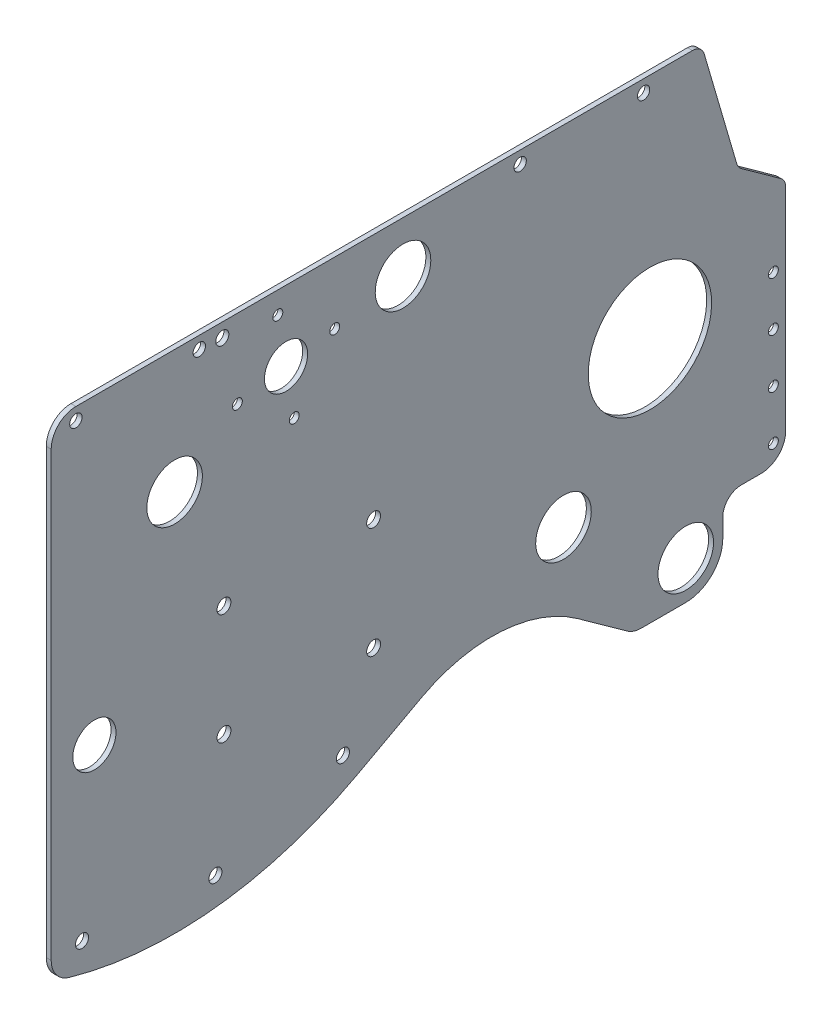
ISO-10303-21;
HEADER;
FILE_DESCRIPTION(('STEP AP214'),'2;1');
FILE_NAME('part.step','',(''),(''),'','','');
FILE_SCHEMA(('AUTOMOTIVE_DESIGN { 1 0 10303 214 1 1 1 1 }'));
ENDSEC;
DATA;
#1=APPLICATION_CONTEXT('core data for automotive mechanical design processes');
#2=APPLICATION_PROTOCOL_DEFINITION('international standard','automotive_design',2000,#1);
#3=PRODUCT_CONTEXT('',#1,'mechanical');
#4=PRODUCT('Part','Part','',(#3));
#5=PRODUCT_RELATED_PRODUCT_CATEGORY('part','',(#4));
#6=PRODUCT_DEFINITION_FORMATION('','',#4);
#7=PRODUCT_DEFINITION_CONTEXT('part definition',#1,'design');
#8=PRODUCT_DEFINITION('design','',#6,#7);
#9=PRODUCT_DEFINITION_SHAPE('','',#8);
#10=(LENGTH_UNIT() NAMED_UNIT(*) SI_UNIT(.MILLI.,.METRE.));
#11=(NAMED_UNIT(*) PLANE_ANGLE_UNIT() SI_UNIT($,.RADIAN.));
#12=(NAMED_UNIT(*) SI_UNIT($,.STERADIAN.) SOLID_ANGLE_UNIT());
#13=UNCERTAINTY_MEASURE_WITH_UNIT(LENGTH_MEASURE(1.E-05),#10,'distance_accuracy_value','');
#14=(GEOMETRIC_REPRESENTATION_CONTEXT(3) GLOBAL_UNCERTAINTY_ASSIGNED_CONTEXT((#13)) GLOBAL_UNIT_ASSIGNED_CONTEXT((#10,
#11,#12)) REPRESENTATION_CONTEXT('',''));
#15=CARTESIAN_POINT('',(0.,0.,0.));
#16=DIRECTION('',(0.,0.,1.));
#17=DIRECTION('',(1.,0.,0.));
#18=AXIS2_PLACEMENT_3D('',#15,#16,#17);
#19=CARTESIAN_POINT('',(228.6,-77.158961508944,250.325730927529));
#20=DIRECTION('',(-1.,0.,0.));
#21=DIRECTION('',(0.,0.,1.));
#22=AXIS2_PLACEMENT_3D('',#19,#20,#21);
#23=CYLINDRICAL_SURFACE('',#22,3.175);
#24=CARTESIAN_POINT('',(-228.6,-77.158961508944,250.325730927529));
#25=DIRECTION('',(-1.,0.,0.));
#26=DIRECTION('',(0.,1.,0.));
#27=AXIS2_PLACEMENT_3D('',#24,#25,#26);
#28=CIRCLE('',#27,3.175);
#29=CARTESIAN_POINT('',(-228.6,-73.983961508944,250.325730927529));
#30=VERTEX_POINT('',#29);
#31=EDGE_CURVE('E345',#30,#30,#28,.T.);
#32=ORIENTED_EDGE('',*,*,#31,.T.);
#33=EDGE_LOOP('',(#32));
#34=FACE_BOUND('',#33,.T.);
#35=CARTESIAN_POINT('',(-226.06,-77.158961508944,250.325730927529));
#36=DIRECTION('',(-1.,0.,0.));
#37=DIRECTION('',(0.,1.,0.));
#38=AXIS2_PLACEMENT_3D('',#35,#36,#37);
#39=CIRCLE('',#38,3.175);
#40=CARTESIAN_POINT('',(-226.06,-73.983961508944,250.325730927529));
#41=VERTEX_POINT('',#40);
#42=EDGE_CURVE('E637',#41,#41,#39,.T.);
#43=ORIENTED_EDGE('',*,*,#42,.F.);
#44=EDGE_LOOP('',(#43));
#45=FACE_BOUND('',#44,.T.);
#46=ADVANCED_FACE('F17',(#34,#45),#23,.F.);
#47=CARTESIAN_POINT('',(228.6,-77.1589615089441,415.425730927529));
#48=DIRECTION('',(-1.,0.,0.));
#49=DIRECTION('',(0.,0.,1.));
#50=AXIS2_PLACEMENT_3D('',#47,#48,#49);
#51=CYLINDRICAL_SURFACE('',#50,3.175);
#52=CARTESIAN_POINT('',(-228.6,-77.1589615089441,415.425730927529));
#53=DIRECTION('',(-1.,0.,0.));
#54=DIRECTION('',(0.,1.,0.));
#55=AXIS2_PLACEMENT_3D('',#52,#53,#54);
#56=CIRCLE('',#55,3.175);
#57=CARTESIAN_POINT('',(-228.6,-73.9839615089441,415.425730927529));
#58=VERTEX_POINT('',#57);
#59=EDGE_CURVE('E354',#58,#58,#56,.T.);
#60=ORIENTED_EDGE('',*,*,#59,.T.);
#61=EDGE_LOOP('',(#60));
#62=FACE_BOUND('',#61,.T.);
#63=CARTESIAN_POINT('',(-226.06,-77.1589615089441,415.425730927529));
#64=DIRECTION('',(-1.,0.,0.));
#65=DIRECTION('',(0.,1.,0.));
#66=AXIS2_PLACEMENT_3D('',#63,#64,#65);
#67=CIRCLE('',#66,3.175);
#68=CARTESIAN_POINT('',(-226.06,-73.9839615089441,415.425730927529));
#69=VERTEX_POINT('',#68);
#70=EDGE_CURVE('E640',#69,#69,#67,.T.);
#71=ORIENTED_EDGE('',*,*,#70,.F.);
#72=EDGE_LOOP('',(#71));
#73=FACE_BOUND('',#72,.T.);
#74=ADVANCED_FACE('F19',(#62,#73),#51,.F.);
#75=CARTESIAN_POINT('',(228.6,-77.158961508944,186.825730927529));
#76=DIRECTION('',(-1.,0.,0.));
#77=DIRECTION('',(0.,0.,1.));
#78=AXIS2_PLACEMENT_3D('',#75,#76,#77);
#79=CYLINDRICAL_SURFACE('',#78,3.175);
#80=CARTESIAN_POINT('',(-228.6,-77.158961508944,186.825730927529));
#81=DIRECTION('',(-1.,0.,0.));
#82=DIRECTION('',(0.,1.,0.));
#83=AXIS2_PLACEMENT_3D('',#80,#81,#82);
#84=CIRCLE('',#83,3.175);
#85=CARTESIAN_POINT('',(-228.6,-73.983961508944,186.825730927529));
#86=VERTEX_POINT('',#85);
#87=EDGE_CURVE('E21',#86,#86,#84,.T.);
#88=ORIENTED_EDGE('',*,*,#87,.T.);
#89=EDGE_LOOP('',(#88));
#90=FACE_BOUND('',#89,.T.);
#91=CARTESIAN_POINT('',(-226.06,-77.158961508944,186.825730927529));
#92=DIRECTION('',(-1.,0.,0.));
#93=DIRECTION('',(0.,1.,0.));
#94=AXIS2_PLACEMENT_3D('',#91,#92,#93);
#95=CIRCLE('',#94,3.175);
#96=CARTESIAN_POINT('',(-226.06,-73.983961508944,186.825730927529));
#97=VERTEX_POINT('',#96);
#98=EDGE_CURVE('E643',#97,#97,#95,.T.);
#99=ORIENTED_EDGE('',*,*,#98,.F.);
#100=EDGE_LOOP('',(#99));
#101=FACE_BOUND('',#100,.T.);
#102=ADVANCED_FACE('F652',(#90,#101),#79,.F.);
#103=CARTESIAN_POINT('',(228.6,-77.1589615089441,478.925730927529));
#104=DIRECTION('',(-1.,0.,0.));
#105=DIRECTION('',(0.,0.,1.));
#106=AXIS2_PLACEMENT_3D('',#103,#104,#105);
#107=CYLINDRICAL_SURFACE('',#106,3.175);
#108=CARTESIAN_POINT('',(-228.6,-77.1589615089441,478.925730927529));
#109=DIRECTION('',(-1.,0.,0.));
#110=DIRECTION('',(0.,1.,0.));
#111=AXIS2_PLACEMENT_3D('',#108,#109,#110);
#112=CIRCLE('',#111,3.175);
#113=CARTESIAN_POINT('',(-228.6,-73.9839615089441,478.925730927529));
#114=VERTEX_POINT('',#113);
#115=EDGE_CURVE('E27',#114,#114,#112,.T.);
#116=ORIENTED_EDGE('',*,*,#115,.T.);
#117=EDGE_LOOP('',(#116));
#118=FACE_BOUND('',#117,.T.);
#119=CARTESIAN_POINT('',(-226.06,-77.1589615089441,478.925730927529));
#120=DIRECTION('',(-1.,0.,0.));
#121=DIRECTION('',(0.,1.,0.));
#122=AXIS2_PLACEMENT_3D('',#119,#120,#121);
#123=CIRCLE('',#122,3.175);
#124=CARTESIAN_POINT('',(-226.06,-73.9839615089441,478.925730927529));
#125=VERTEX_POINT('',#124);
#126=EDGE_CURVE('E503',#125,#125,#123,.T.);
#127=ORIENTED_EDGE('',*,*,#126,.F.);
#128=EDGE_LOOP('',(#127));
#129=FACE_BOUND('',#128,.T.);
#130=ADVANCED_FACE('F654',(#118,#129),#107,.F.);
#131=CARTESIAN_POINT('',(-228.6,-77.9527115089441,403.584172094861));
#132=DIRECTION('',(1.,0.,0.));
#133=DIRECTION('',(0.,1.,0.));
#134=AXIS2_PLACEMENT_3D('',#131,#132,#133);
#135=CYLINDRICAL_SURFACE('',#134,3.37343750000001);
#136=CARTESIAN_POINT('',(-228.6,-77.9527115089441,403.584172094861));
#137=DIRECTION('',(1.,0.,0.));
#138=DIRECTION('',(0.,1.,0.));
#139=AXIS2_PLACEMENT_3D('',#136,#137,#138);
#140=CIRCLE('',#139,3.37343750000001);
#141=CARTESIAN_POINT('',(-228.6,-74.5792740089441,403.584172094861));
#142=VERTEX_POINT('',#141);
#143=EDGE_CURVE('E11',#142,#142,#140,.T.);
#144=ORIENTED_EDGE('',*,*,#143,.F.);
#145=EDGE_LOOP('',(#144));
#146=FACE_BOUND('',#145,.T.);
#147=CARTESIAN_POINT('',(-226.06,-77.9527115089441,403.584172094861));
#148=DIRECTION('',(-1.,0.,0.));
#149=DIRECTION('',(0.,1.,0.));
#150=AXIS2_PLACEMENT_3D('',#147,#148,#149);
#151=CIRCLE('',#150,3.37343750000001);
#152=CARTESIAN_POINT('',(-226.06,-74.5792740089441,403.584172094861));
#153=VERTEX_POINT('',#152);
#154=EDGE_CURVE('E500',#153,#153,#151,.T.);
#155=ORIENTED_EDGE('',*,*,#154,.F.);
#156=EDGE_LOOP('',(#155));
#157=FACE_BOUND('',#156,.T.);
#158=ADVANCED_FACE('F663',(#146,#157),#135,.F.);
#159=CARTESIAN_POINT('',(-228.6,-3.72632197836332,256.925365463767));
#160=DIRECTION('',(1.,0.,0.));
#161=DIRECTION('',(0.,-1.,0.));
#162=AXIS2_PLACEMENT_3D('',#159,#160,#161);
#163=PLANE('',#162);
#164=CARTESIAN_POINT('',(-228.6,-241.3,120.015000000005));
#165=DIRECTION('',(1.,0.,0.));
#166=DIRECTION('',(0.,0.,-1.));
#167=AXIS2_PLACEMENT_3D('',#164,#165,#166);
#168=CIRCLE('',#167,2.5527);
#169=CARTESIAN_POINT('',(-228.6,-241.3,117.462300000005));
#170=VERTEX_POINT('',#169);
#171=EDGE_CURVE('E636',#170,#170,#168,.T.);
#172=ORIENTED_EDGE('',*,*,#171,.T.);
#173=EDGE_LOOP('',(#172));
#174=FACE_BOUND('',#173,.T.);
#175=CARTESIAN_POINT('',(-228.6,-266.7,120.015000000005));
#176=DIRECTION('',(1.,0.,0.));
#177=DIRECTION('',(0.,0.,-1.));
#178=AXIS2_PLACEMENT_3D('',#175,#176,#177);
#179=CIRCLE('',#178,2.5527);
#180=CARTESIAN_POINT('',(-228.6,-266.7,117.462300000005));
#181=VERTEX_POINT('',#180);
#182=EDGE_CURVE('E560',#181,#181,#179,.T.);
#183=ORIENTED_EDGE('',*,*,#182,.T.);
#184=EDGE_LOOP('',(#183));
#185=FACE_BOUND('',#184,.T.);
#186=CARTESIAN_POINT('',(-228.6,-215.9,120.015000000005));
#187=DIRECTION('',(1.,0.,0.));
#188=DIRECTION('',(0.,0.,-1.));
#189=AXIS2_PLACEMENT_3D('',#186,#187,#188);
#190=CIRCLE('',#189,2.5527);
#191=CARTESIAN_POINT('',(-228.6,-215.9,117.462300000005));
#192=VERTEX_POINT('',#191);
#193=EDGE_CURVE('E566',#192,#192,#190,.T.);
#194=ORIENTED_EDGE('',*,*,#193,.T.);
#195=EDGE_LOOP('',(#194));
#196=FACE_BOUND('',#195,.T.);
#197=CARTESIAN_POINT('',(-228.6,-190.5,120.015000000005));
#198=DIRECTION('',(1.,0.,0.));
#199=DIRECTION('',(0.,0.,-1.));
#200=AXIS2_PLACEMENT_3D('',#197,#198,#199);
#201=CIRCLE('',#200,2.5527);
#202=CARTESIAN_POINT('',(-228.6,-190.5,117.462300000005));
#203=VERTEX_POINT('',#202);
#204=EDGE_CURVE('E507',#203,#203,#201,.T.);
#205=ORIENTED_EDGE('',*,*,#204,.T.);
#206=EDGE_LOOP('',(#205));
#207=FACE_BOUND('',#206,.T.);
#208=CARTESIAN_POINT('',(-228.6,-188.215326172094,183.545553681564));
#209=DIRECTION('',(1.,0.,0.));
#210=DIRECTION('',(0.,1.,0.));
#211=AXIS2_PLACEMENT_3D('',#208,#209,#210);
#212=CIRCLE('',#211,31.75);
#213=CARTESIAN_POINT('',(-228.6,-156.465326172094,183.545553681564));
#214=VERTEX_POINT('',#213);
#215=EDGE_CURVE('E443',#214,#214,#212,.T.);
#216=ORIENTED_EDGE('',*,*,#215,.T.);
#217=EDGE_LOOP('',(#216));
#218=FACE_BOUND('',#217,.T.);
#219=CARTESIAN_POINT('',(-228.6,-226.383961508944,469.400730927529));
#220=DIRECTION('',(1.,0.,0.));
#221=DIRECTION('',(0.,1.,0.));
#222=AXIS2_PLACEMENT_3D('',#219,#220,#221);
#223=CIRCLE('',#222,11.1125);
#224=CARTESIAN_POINT('',(-228.6,-215.271461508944,469.400730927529));
#225=VERTEX_POINT('',#224);
#226=EDGE_CURVE('E442',#225,#225,#223,.T.);
#227=ORIENTED_EDGE('',*,*,#226,.T.);
#228=EDGE_LOOP('',(#227));
#229=FACE_BOUND('',#228,.T.);
#230=CARTESIAN_POINT('',(-228.6,-254.958961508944,325.731980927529));
#231=DIRECTION('',(1.,0.,0.));
#232=DIRECTION('',(0.,1.,0.));
#233=AXIS2_PLACEMENT_3D('',#230,#231,#232);
#234=CIRCLE('',#233,3.571875);
#235=CARTESIAN_POINT('',(-228.6,-251.387086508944,325.731980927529));
#236=VERTEX_POINT('',#235);
#237=EDGE_CURVE('E453',#236,#236,#234,.T.);
#238=ORIENTED_EDGE('',*,*,#237,.T.);
#239=EDGE_LOOP('',(#238));
#240=FACE_BOUND('',#239,.T.);
#241=CARTESIAN_POINT('',(-228.6,-197.808961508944,325.731980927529));
#242=DIRECTION('',(1.,0.,0.));
#243=DIRECTION('',(0.,1.,0.));
#244=AXIS2_PLACEMENT_3D('',#241,#242,#243);
#245=CIRCLE('',#244,3.571875);
#246=CARTESIAN_POINT('',(-228.6,-194.237086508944,325.731980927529));
#247=VERTEX_POINT('',#246);
#248=EDGE_CURVE('E586',#247,#247,#245,.T.);
#249=ORIENTED_EDGE('',*,*,#248,.T.);
#250=EDGE_LOOP('',(#249));
#251=FACE_BOUND('',#250,.T.);
#252=CARTESIAN_POINT('',(-228.6,-254.958961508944,402.725730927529));
#253=DIRECTION('',(1.,0.,0.));
#254=DIRECTION('',(0.,1.,0.));
#255=AXIS2_PLACEMENT_3D('',#252,#253,#254);
#256=CIRCLE('',#255,3.571875);
#257=CARTESIAN_POINT('',(-228.6,-251.387086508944,402.725730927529));
#258=VERTEX_POINT('',#257);
#259=EDGE_CURVE('E583',#258,#258,#256,.T.);
#260=ORIENTED_EDGE('',*,*,#259,.T.);
#261=EDGE_LOOP('',(#260));
#262=FACE_BOUND('',#261,.T.);
#263=CARTESIAN_POINT('',(-228.6,-197.808961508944,402.725730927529));
#264=DIRECTION('',(1.,0.,0.));
#265=DIRECTION('',(0.,1.,0.));
#266=AXIS2_PLACEMENT_3D('',#263,#264,#265);
#267=CIRCLE('',#266,3.571875);
#268=CARTESIAN_POINT('',(-228.6,-194.237086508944,402.725730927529));
#269=VERTEX_POINT('',#268);
#270=EDGE_CURVE('E496',#269,#269,#267,.T.);
#271=ORIENTED_EDGE('',*,*,#270,.T.);
#272=EDGE_LOOP('',(#271));
#273=FACE_BOUND('',#272,.T.);
#274=CARTESIAN_POINT('',(-228.6,-111.257356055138,395.829355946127));
#275=DIRECTION('',(1.,0.,0.));
#276=DIRECTION('',(0.,1.,0.));
#277=AXIS2_PLACEMENT_3D('',#274,#275,#276);
#278=CIRCLE('',#277,2.5527);
#279=CARTESIAN_POINT('',(-228.6,-108.704656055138,395.829355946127));
#280=VERTEX_POINT('',#279);
#281=EDGE_CURVE('E495',#280,#280,#278,.T.);
#282=ORIENTED_EDGE('',*,*,#281,.T.);
#283=EDGE_LOOP('',(#282));
#284=FACE_BOUND('',#283,.T.);
#285=CARTESIAN_POINT('',(-228.6,-81.9845061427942,375.010608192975));
#286=DIRECTION('',(1.,0.,0.));
#287=DIRECTION('',(0.,1.,0.));
#288=AXIS2_PLACEMENT_3D('',#285,#286,#287);
#289=CIRCLE('',#288,2.5527);
#290=CARTESIAN_POINT('',(-228.6,-79.4318061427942,375.010608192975));
#291=VERTEX_POINT('',#290);
#292=EDGE_CURVE('E599',#291,#291,#289,.T.);
#293=ORIENTED_EDGE('',*,*,#292,.T.);
#294=EDGE_LOOP('',(#293));
#295=FACE_BOUND('',#294,.T.);
#296=CARTESIAN_POINT('',(-228.6,-102.803253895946,345.73775828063));
#297=DIRECTION('',(1.,0.,0.));
#298=DIRECTION('',(0.,1.,0.));
#299=AXIS2_PLACEMENT_3D('',#296,#297,#298);
#300=CIRCLE('',#299,2.5527);
#301=CARTESIAN_POINT('',(-228.6,-100.250553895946,345.73775828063));
#302=VERTEX_POINT('',#301);
#303=EDGE_CURVE('E610',#302,#302,#300,.T.);
#304=ORIENTED_EDGE('',*,*,#303,.T.);
#305=EDGE_LOOP('',(#304));
#306=FACE_BOUND('',#305,.T.);
#307=CARTESIAN_POINT('',(-228.6,-132.07610380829,366.556506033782));
#308=DIRECTION('',(1.,0.,0.));
#309=DIRECTION('',(0.,1.,0.));
#310=AXIS2_PLACEMENT_3D('',#307,#308,#309);
#311=CIRCLE('',#310,2.5527);
#312=CARTESIAN_POINT('',(-228.6,-129.52340380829,366.556506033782));
#313=VERTEX_POINT('',#312);
#314=EDGE_CURVE('E463',#313,#313,#311,.T.);
#315=ORIENTED_EDGE('',*,*,#314,.T.);
#316=EDGE_LOOP('',(#315));
#317=FACE_BOUND('',#316,.T.);
#318=CARTESIAN_POINT('',(-228.6,-107.030304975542,370.783557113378));
#319=DIRECTION('',(1.,0.,0.));
#320=DIRECTION('',(0.,1.,0.));
#321=AXIS2_PLACEMENT_3D('',#318,#319,#320);
#322=CIRCLE('',#321,11.1125);
#323=CARTESIAN_POINT('',(-228.6,-95.9178049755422,370.783557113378));
#324=VERTEX_POINT('',#323);
#325=EDGE_CURVE('E546',#324,#324,#322,.T.);
#326=ORIENTED_EDGE('',*,*,#325,.T.);
#327=EDGE_LOOP('',(#326));
#328=FACE_BOUND('',#327,.T.);
#329=CARTESIAN_POINT('',(-228.6,-295.01791023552,341.513374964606));
#330=DIRECTION('',(1.,0.,0.));
#331=DIRECTION('',(0.,1.,0.));
#332=AXIS2_PLACEMENT_3D('',#329,#330,#331);
#333=CIRCLE('',#332,3.37343750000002);
#334=CARTESIAN_POINT('',(-228.6,-291.64447273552,341.513374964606));
#335=VERTEX_POINT('',#334);
#336=EDGE_CURVE('E619',#335,#335,#333,.T.);
#337=ORIENTED_EDGE('',*,*,#336,.T.);
#338=EDGE_LOOP('',(#337));
#339=FACE_BOUND('',#338,.T.);
#340=CARTESIAN_POINT('',(-228.600000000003,-315.661521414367,407.142036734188));
#341=DIRECTION('',(1.,0.,0.));
#342=DIRECTION('',(0.,1.,0.));
#343=AXIS2_PLACEMENT_3D('',#340,#341,#342);
#344=CIRCLE('',#343,3.3734375);
#345=CARTESIAN_POINT('',(-228.600000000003,-312.288083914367,407.142036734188));
#346=VERTEX_POINT('',#345);
#347=EDGE_CURVE('E603',#346,#346,#344,.T.);
#348=ORIENTED_EDGE('',*,*,#347,.T.);
#349=EDGE_LOOP('',(#348));
#350=FACE_BOUND('',#349,.T.);
#351=CARTESIAN_POINT('',(-228.600000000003,-310.550062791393,475.750730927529));
#352=DIRECTION('',(1.,0.,0.));
#353=DIRECTION('',(0.,1.,0.));
#354=AXIS2_PLACEMENT_3D('',#351,#352,#353);
#355=CIRCLE('',#354,3.37343750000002);
#356=CARTESIAN_POINT('',(-228.600000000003,-307.176625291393,475.750730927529));
#357=VERTEX_POINT('',#356);
#358=EDGE_CURVE('E628',#357,#357,#355,.T.);
#359=ORIENTED_EDGE('',*,*,#358,.T.);
#360=EDGE_LOOP('',(#359));
#361=FACE_BOUND('',#360,.T.);
#362=CARTESIAN_POINT('',(-228.6,-96.8727012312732,310.598502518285));
#363=DIRECTION('',(1.,0.,0.));
#364=DIRECTION('',(0.,1.,0.));
#365=AXIS2_PLACEMENT_3D('',#362,#363,#364);
#366=CIRCLE('',#365,14.3002);
#367=CARTESIAN_POINT('',(-228.6,-82.5725012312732,310.598502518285));
#368=VERTEX_POINT('',#367);
#369=EDGE_CURVE('E613',#368,#368,#366,.T.);
#370=ORIENTED_EDGE('',*,*,#369,.T.);
#371=EDGE_LOOP('',(#370));
#372=FACE_BOUND('',#371,.T.);
#373=CARTESIAN_POINT('',(-228.6,-134.308961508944,428.125730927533));
#374=DIRECTION('',(1.,0.,0.));
#375=DIRECTION('',(0.,1.,0.));
#376=AXIS2_PLACEMENT_3D('',#373,#374,#375);
#377=CIRCLE('',#376,14.3002);
#378=CARTESIAN_POINT('',(-228.6,-120.008761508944,428.125730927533));
#379=VERTEX_POINT('',#378);
#380=EDGE_CURVE('E524',#379,#379,#377,.T.);
#381=ORIENTED_EDGE('',*,*,#380,.T.);
#382=EDGE_LOOP('',(#381));
#383=FACE_BOUND('',#382,.T.);
#384=CARTESIAN_POINT('',(-228.6,-250.085515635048,228.026107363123));
#385=DIRECTION('',(1.,0.,0.));
#386=DIRECTION('',(0.,1.,0.));
#387=AXIS2_PLACEMENT_3D('',#384,#385,#386);
#388=CIRCLE('',#387,14.3002);
#389=CARTESIAN_POINT('',(-228.6,-235.785315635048,228.026107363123));
#390=VERTEX_POINT('',#389);
#391=EDGE_CURVE('E519',#390,#390,#388,.T.);
#392=ORIENTED_EDGE('',*,*,#391,.T.);
#393=EDGE_LOOP('',(#392));
#394=FACE_BOUND('',#393,.T.);
#395=CARTESIAN_POINT('',(-228.6,-295.32520409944,165.1));
#396=DIRECTION('',(1.,0.,0.));
#397=DIRECTION('',(0.,1.,0.));
#398=AXIS2_PLACEMENT_3D('',#395,#396,#397);
#399=CIRCLE('',#398,14.3002);
#400=CARTESIAN_POINT('',(-228.6,-281.02500409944,165.1));
#401=VERTEX_POINT('',#400);
#402=EDGE_CURVE('E556',#401,#401,#399,.T.);
#403=ORIENTED_EDGE('',*,*,#402,.T.);
#404=EDGE_LOOP('',(#403));
#405=FACE_BOUND('',#404,.T.);
#406=DIRECTION('',(0.,0.,1.));
#407=VECTOR('',#406,1.);
#408=CARTESIAN_POINT('',(-228.6,-276.987,131.445000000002));
#409=LINE('',#408,#407);
#410=CARTESIAN_POINT('',(-228.6,-276.987,126.365000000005));
#411=VERTEX_POINT('',#410);
#412=CARTESIAN_POINT('',(-228.6,-276.987,136.525));
#413=VERTEX_POINT('',#412);
#414=EDGE_CURVE('E1393',#411,#413,#409,.T.);
#415=ORIENTED_EDGE('',*,*,#414,.T.);
#416=CARTESIAN_POINT('',(-228.6,-286.512,136.525));
#417=DIRECTION('',(1.,0.,0.));
#418=DIRECTION('',(0.,1.,0.));
#419=AXIS2_PLACEMENT_3D('',#416,#417,#418);
#420=CIRCLE('',#419,9.525);
#421=CARTESIAN_POINT('',(-228.6,-286.512,146.05));
#422=VERTEX_POINT('',#421);
#423=EDGE_CURVE('E552',#413,#422,#420,.T.);
#424=ORIENTED_EDGE('',*,*,#423,.T.);
#425=DIRECTION('',(0.,-1.,0.));
#426=VECTOR('',#425,1.);
#427=CARTESIAN_POINT('',(-228.6,-291.2745,146.05));
#428=LINE('',#427,#426);
#429=CARTESIAN_POINT('',(-228.6,-296.037,146.05));
#430=VERTEX_POINT('',#429);
#431=EDGE_CURVE('E433',#422,#430,#428,.T.);
#432=ORIENTED_EDGE('',*,*,#431,.T.);
#433=CARTESIAN_POINT('',(-228.6,-296.037,165.1));
#434=DIRECTION('',(1.,0.,0.));
#435=DIRECTION('',(0.,1.,0.));
#436=AXIS2_PLACEMENT_3D('',#433,#434,#435);
#437=CIRCLE('',#436,19.05);
#438=CARTESIAN_POINT('',(-228.6,-315.087,165.1));
#439=VERTEX_POINT('',#438);
#440=EDGE_CURVE('E537',#439,#430,#437,.T.);
#441=ORIENTED_EDGE('',*,*,#440,.F.);
#442=DIRECTION('',(0.,0.,1.));
#443=VECTOR('',#442,1.);
#444=CARTESIAN_POINT('',(-228.6,-315.087,176.506055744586));
#445=LINE('',#444,#443);
#446=CARTESIAN_POINT('',(-228.6,-315.087,187.912111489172));
#447=VERTEX_POINT('',#446);
#448=EDGE_CURVE('E905',#439,#447,#445,.T.);
#449=ORIENTED_EDGE('',*,*,#448,.T.);
#450=CARTESIAN_POINT('',(-228.6,-302.386999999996,187.912111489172));
#451=DIRECTION('',(1.,0.,0.));
#452=DIRECTION('',(0.,1.,0.));
#453=AXIS2_PLACEMENT_3D('',#450,#451,#452);
#454=CIRCLE('',#453,12.7000000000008);
#455=CARTESIAN_POINT('',(-228.6,-312.698698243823,195.325537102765));
#456=VERTEX_POINT('',#455);
#457=EDGE_CURVE('E508',#456,#447,#454,.T.);
#458=ORIENTED_EDGE('',*,*,#457,.F.);
#459=DIRECTION('',(0.,0.583734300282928,0.811944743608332));
#460=VECTOR('',#459,1.);
#461=CARTESIAN_POINT('',(-228.6,-303.676016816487,207.87562839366));
#462=LINE('',#461,#460);
#463=CARTESIAN_POINT('',(-228.6,-294.653335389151,220.425719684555));
#464=VERTEX_POINT('',#463);
#465=EDGE_CURVE('E499',#456,#464,#462,.T.);
#466=ORIENTED_EDGE('',*,*,#465,.T.);
#467=CARTESIAN_POINT('',(-228.600000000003,-356.523524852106,264.906273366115));
#468=DIRECTION('',(1.,0.,0.));
#469=DIRECTION('',(0.,1.,0.));
#470=AXIS2_PLACEMENT_3D('',#467,#468,#469);
#471=CIRCLE('',#470,76.2);
#472=CARTESIAN_POINT('',(-228.6,-289.445007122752,301.057517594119));
#473=VERTEX_POINT('',#472);
#474=EDGE_CURVE('E484',#464,#473,#471,.T.);
#475=ORIENTED_EDGE('',*,*,#474,.T.);
#476=DIRECTION('',(0.,-0.474425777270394,0.880295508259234));
#477=VECTOR('',#476,1.);
#478=CARTESIAN_POINT('',(-228.6,-298.520069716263,317.896267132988));
#479=LINE('',#478,#477);
#480=CARTESIAN_POINT('',(-228.6,-307.595132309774,334.735016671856));
#481=VERTEX_POINT('',#480);
#482=EDGE_CURVE('E473',#473,#481,#479,.T.);
#483=ORIENTED_EDGE('',*,*,#482,.T.);
#484=CARTESIAN_POINT('',(-228.6,-134.308961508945,428.125730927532));
#485=DIRECTION('',(1.,0.,0.));
#486=DIRECTION('',(0.,1.,0.));
#487=AXIS2_PLACEMENT_3D('',#484,#485,#486);
#488=CIRCLE('',#487,196.85);
#489=CARTESIAN_POINT('',(-228.600000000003,-323.520636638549,482.429179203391));
#490=VERTEX_POINT('',#489);
#491=EDGE_CURVE('E454',#490,#481,#488,.T.);
#492=ORIENTED_EDGE('',*,*,#491,.F.);
#493=CARTESIAN_POINT('',(-228.600000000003,-311.313431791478,478.925730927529));
#494=DIRECTION('',(1.,0.,0.));
#495=DIRECTION('',(0.,1.,0.));
#496=AXIS2_PLACEMENT_3D('',#493,#494,#495);
#497=CIRCLE('',#496,12.7000000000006);
#498=CARTESIAN_POINT('',(-228.600000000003,-311.313431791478,491.625730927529));
#499=VERTEX_POINT('',#498);
#500=EDGE_CURVE('E403',#499,#490,#497,.T.);
#501=ORIENTED_EDGE('',*,*,#500,.F.);
#502=DIRECTION('',(0.,1.,0.));
#503=VECTOR('',#502,1.);
#504=CARTESIAN_POINT('',(-228.6,-197.411196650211,491.625730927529));
#505=LINE('',#504,#503);
#506=CARTESIAN_POINT('',(-228.6,-83.5089615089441,491.625730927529));
#507=VERTEX_POINT('',#506);
#508=EDGE_CURVE('E416',#499,#507,#505,.T.);
#509=ORIENTED_EDGE('',*,*,#508,.T.);
#510=CARTESIAN_POINT('',(-228.6,-83.5089615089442,478.925730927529));
#511=DIRECTION('',(1.,0.,0.));
#512=DIRECTION('',(0.,1.,0.));
#513=AXIS2_PLACEMENT_3D('',#510,#511,#512);
#514=CIRCLE('',#513,12.7);
#515=CARTESIAN_POINT('',(-228.6,-70.8089615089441,478.925730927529));
#516=VERTEX_POINT('',#515);
#517=EDGE_CURVE('E419',#516,#507,#514,.T.);
#518=ORIENTED_EDGE('',*,*,#517,.F.);
#519=DIRECTION('',(0.,0.,-1.));
#520=VECTOR('',#519,1.);
#521=CARTESIAN_POINT('',(-228.6,-70.8089615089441,320.315205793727));
#522=LINE('',#521,#520);
#523=CARTESIAN_POINT('',(-228.6,-70.808961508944,161.704680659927));
#524=VERTEX_POINT('',#523);
#525=EDGE_CURVE('E830',#516,#524,#522,.T.);
#526=ORIENTED_EDGE('',*,*,#525,.T.);
#527=CARTESIAN_POINT('',(-228.6,-77.1589615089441,161.704680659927));
#528=DIRECTION('',(1.,0.,0.));
#529=DIRECTION('',(0.,1.,0.));
#530=AXIS2_PLACEMENT_3D('',#527,#528,#529);
#531=CIRCLE('',#530,6.35);
#532=CARTESIAN_POINT('',(-228.6,-75.3781772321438,155.609493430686));
#533=VERTEX_POINT('',#532);
#534=EDGE_CURVE('E900',#533,#524,#531,.T.);
#535=ORIENTED_EDGE('',*,*,#534,.F.);
#536=DIRECTION('',(0.,-0.959872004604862,-0.28043846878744));
#537=VECTOR('',#536,1.);
#538=CARTESIAN_POINT('',(-228.6,-104.00981146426,147.244407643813));
#539=LINE('',#538,#537);
#540=CARTESIAN_POINT('',(-228.6,-132.641445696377,138.879321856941));
#541=VERTEX_POINT('',#540);
#542=EDGE_CURVE('E886',#533,#541,#539,.T.);
#543=ORIENTED_EDGE('',*,*,#542,.T.);
#544=CARTESIAN_POINT('',(-228.6,-130.860661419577,132.7841346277));
#545=DIRECTION('',(1.,0.,0.));
#546=DIRECTION('',(0.,1.,0.));
#547=AXIS2_PLACEMENT_3D('',#544,#545,#546);
#548=CIRCLE('',#547,6.35);
#549=CARTESIAN_POINT('',(-228.6,-136.016510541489,136.490847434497));
#550=VERTEX_POINT('',#549);
#551=EDGE_CURVE('E871',#541,#550,#548,.T.);
#552=ORIENTED_EDGE('',*,*,#551,.T.);
#553=DIRECTION('',(0.,0.58373430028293,0.811944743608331));
#554=VECTOR('',#553,1.);
#555=CARTESIAN_POINT('',(-228.6,-143.271470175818,126.399567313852));
#556=LINE('',#555,#554);
#557=CARTESIAN_POINT('',(-228.6,-150.526429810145,116.308287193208));
#558=VERTEX_POINT('',#557);
#559=EDGE_CURVE('E867',#558,#550,#556,.T.);
#560=ORIENTED_EDGE('',*,*,#559,.F.);
#561=CARTESIAN_POINT('',(-228.6,-155.682278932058,120.015000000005));
#562=DIRECTION('',(1.,0.,0.));
#563=DIRECTION('',(0.,1.,0.));
#564=AXIS2_PLACEMENT_3D('',#561,#562,#563);
#565=CIRCLE('',#564,6.35);
#566=CARTESIAN_POINT('',(-228.6,-155.682278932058,113.665000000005));
#567=VERTEX_POINT('',#566);
#568=EDGE_CURVE('E852',#567,#558,#565,.T.);
#569=ORIENTED_EDGE('',*,*,#568,.F.);
#570=DIRECTION('',(0.,-1.,0.));
#571=VECTOR('',#570,1.);
#572=CARTESIAN_POINT('',(-228.6,-209.984639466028,113.665000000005));
#573=LINE('',#572,#571);
#574=CARTESIAN_POINT('',(-228.6,-264.287,113.665000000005));
#575=VERTEX_POINT('',#574);
#576=EDGE_CURVE('E924',#567,#575,#573,.T.);
#577=ORIENTED_EDGE('',*,*,#576,.T.);
#578=CARTESIAN_POINT('',(-228.6,-264.287,126.365000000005));
#579=DIRECTION('',(1.,0.,0.));
#580=DIRECTION('',(0.,1.,0.));
#581=AXIS2_PLACEMENT_3D('',#578,#579,#580);
#582=CIRCLE('',#581,12.7000000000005);
#583=EDGE_CURVE('E950',#411,#575,#582,.T.);
#584=ORIENTED_EDGE('',*,*,#583,.F.);
#585=EDGE_LOOP('',(#415,#424,#432,#441,#449,#458,#466,#475,#483,#492,#501,#509,#518,#526,#535,
#543,#552,#560,#569,#577,#584));
#586=FACE_BOUND('',#585,.T.);
#587=ORIENTED_EDGE('',*,*,#143,.T.);
#588=EDGE_LOOP('',(#587));
#589=FACE_BOUND('',#588,.T.);
#590=ORIENTED_EDGE('',*,*,#115,.F.);
#591=EDGE_LOOP('',(#590));
#592=FACE_BOUND('',#591,.T.);
#593=ORIENTED_EDGE('',*,*,#87,.F.);
#594=EDGE_LOOP('',(#593));
#595=FACE_BOUND('',#594,.T.);
#596=ORIENTED_EDGE('',*,*,#59,.F.);
#597=EDGE_LOOP('',(#596));
#598=FACE_BOUND('',#597,.T.);
#599=ORIENTED_EDGE('',*,*,#31,.F.);
#600=EDGE_LOOP('',(#599));
#601=FACE_BOUND('',#600,.T.);
#602=ADVANCED_FACE('F703',(#174,#185,#196,#207,#218,#229,#240,#251,#262,#273,#284,#295,#306,
#317,#328,#339,#350,#361,#372,#383,#394,#405,#586,#589,#592,#595,#598,#601),#163,.F.);
#603=CARTESIAN_POINT('',(-226.06,-3.72632197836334,256.925365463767));
#604=DIRECTION('',(1.,0.,0.));
#605=DIRECTION('',(0.,-1.,0.));
#606=AXIS2_PLACEMENT_3D('',#603,#604,#605);
#607=PLANE('',#606);
#608=CARTESIAN_POINT('',(-226.06,-241.3,120.015000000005));
#609=DIRECTION('',(1.,0.,0.));
#610=DIRECTION('',(0.,0.,-1.));
#611=AXIS2_PLACEMENT_3D('',#608,#609,#610);
#612=CIRCLE('',#611,2.5527);
#613=CARTESIAN_POINT('',(-226.06,-241.3,117.462300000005));
#614=VERTEX_POINT('',#613);
#615=EDGE_CURVE('E633',#614,#614,#612,.T.);
#616=ORIENTED_EDGE('',*,*,#615,.F.);
#617=EDGE_LOOP('',(#616));
#618=FACE_BOUND('',#617,.T.);
#619=CARTESIAN_POINT('',(-226.06,-266.7,120.015000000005));
#620=DIRECTION('',(1.,0.,0.));
#621=DIRECTION('',(0.,0.,-1.));
#622=AXIS2_PLACEMENT_3D('',#619,#620,#621);
#623=CIRCLE('',#622,2.5527);
#624=CARTESIAN_POINT('',(-226.06,-266.7,117.462300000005));
#625=VERTEX_POINT('',#624);
#626=EDGE_CURVE('E559',#625,#625,#623,.T.);
#627=ORIENTED_EDGE('',*,*,#626,.F.);
#628=EDGE_LOOP('',(#627));
#629=FACE_BOUND('',#628,.T.);
#630=CARTESIAN_POINT('',(-226.06,-215.9,120.015000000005));
#631=DIRECTION('',(1.,0.,0.));
#632=DIRECTION('',(0.,0.,-1.));
#633=AXIS2_PLACEMENT_3D('',#630,#631,#632);
#634=CIRCLE('',#633,2.5527);
#635=CARTESIAN_POINT('',(-226.06,-215.9,117.462300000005));
#636=VERTEX_POINT('',#635);
#637=EDGE_CURVE('E563',#636,#636,#634,.T.);
#638=ORIENTED_EDGE('',*,*,#637,.F.);
#639=EDGE_LOOP('',(#638));
#640=FACE_BOUND('',#639,.T.);
#641=CARTESIAN_POINT('',(-226.06,-190.5,120.015000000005));
#642=DIRECTION('',(1.,0.,0.));
#643=DIRECTION('',(0.,0.,-1.));
#644=AXIS2_PLACEMENT_3D('',#641,#642,#643);
#645=CIRCLE('',#644,2.5527);
#646=CARTESIAN_POINT('',(-226.06,-190.5,117.462300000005));
#647=VERTEX_POINT('',#646);
#648=EDGE_CURVE('E573',#647,#647,#645,.T.);
#649=ORIENTED_EDGE('',*,*,#648,.F.);
#650=EDGE_LOOP('',(#649));
#651=FACE_BOUND('',#650,.T.);
#652=CARTESIAN_POINT('',(-226.06,-188.215326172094,183.545553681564));
#653=DIRECTION('',(1.,0.,0.));
#654=DIRECTION('',(0.,1.,0.));
#655=AXIS2_PLACEMENT_3D('',#652,#653,#654);
#656=CIRCLE('',#655,31.75);
#657=CARTESIAN_POINT('',(-226.06,-156.465326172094,183.545553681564));
#658=VERTEX_POINT('',#657);
#659=EDGE_CURVE('E504',#658,#658,#656,.T.);
#660=ORIENTED_EDGE('',*,*,#659,.F.);
#661=EDGE_LOOP('',(#660));
#662=FACE_BOUND('',#661,.T.);
#663=CARTESIAN_POINT('',(-226.060000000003,-226.383961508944,469.400730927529));
#664=DIRECTION('',(1.,0.,0.));
#665=DIRECTION('',(0.,1.,0.));
#666=AXIS2_PLACEMENT_3D('',#663,#664,#665);
#667=CIRCLE('',#666,11.1125);
#668=CARTESIAN_POINT('',(-226.06,-215.271461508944,469.400730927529));
#669=VERTEX_POINT('',#668);
#670=EDGE_CURVE('E439',#669,#669,#667,.T.);
#671=ORIENTED_EDGE('',*,*,#670,.F.);
#672=EDGE_LOOP('',(#671));
#673=FACE_BOUND('',#672,.T.);
#674=CARTESIAN_POINT('',(-226.060000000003,-254.958961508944,325.731980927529));
#675=DIRECTION('',(1.,0.,0.));
#676=DIRECTION('',(0.,1.,0.));
#677=AXIS2_PLACEMENT_3D('',#674,#675,#676);
#678=CIRCLE('',#677,3.571875);
#679=CARTESIAN_POINT('',(-226.06,-251.387086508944,325.731980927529));
#680=VERTEX_POINT('',#679);
#681=EDGE_CURVE('E449',#680,#680,#678,.T.);
#682=ORIENTED_EDGE('',*,*,#681,.F.);
#683=EDGE_LOOP('',(#682));
#684=FACE_BOUND('',#683,.T.);
#685=CARTESIAN_POINT('',(-226.06,-197.808961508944,325.731980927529));
#686=DIRECTION('',(1.,0.,0.));
#687=DIRECTION('',(0.,1.,0.));
#688=AXIS2_PLACEMENT_3D('',#685,#686,#687);
#689=CIRCLE('',#688,3.571875);
#690=CARTESIAN_POINT('',(-226.06,-194.237086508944,325.731980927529));
#691=VERTEX_POINT('',#690);
#692=EDGE_CURVE('E578',#691,#691,#689,.T.);
#693=ORIENTED_EDGE('',*,*,#692,.F.);
#694=EDGE_LOOP('',(#693));
#695=FACE_BOUND('',#694,.T.);
#696=CARTESIAN_POINT('',(-226.060000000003,-254.958961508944,402.725730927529));
#697=DIRECTION('',(1.,0.,0.));
#698=DIRECTION('',(0.,1.,0.));
#699=AXIS2_PLACEMENT_3D('',#696,#697,#698);
#700=CIRCLE('',#699,3.571875);
#701=CARTESIAN_POINT('',(-226.06,-251.387086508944,402.725730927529));
#702=VERTEX_POINT('',#701);
#703=EDGE_CURVE('E589',#702,#702,#700,.T.);
#704=ORIENTED_EDGE('',*,*,#703,.F.);
#705=EDGE_LOOP('',(#704));
#706=FACE_BOUND('',#705,.T.);
#707=CARTESIAN_POINT('',(-226.06,-197.808961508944,402.725730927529));
#708=DIRECTION('',(1.,0.,0.));
#709=DIRECTION('',(0.,1.,0.));
#710=AXIS2_PLACEMENT_3D('',#707,#708,#709);
#711=CIRCLE('',#710,3.571875);
#712=CARTESIAN_POINT('',(-226.06,-194.237086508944,402.725730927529));
#713=VERTEX_POINT('',#712);
#714=EDGE_CURVE('E579',#713,#713,#711,.T.);
#715=ORIENTED_EDGE('',*,*,#714,.F.);
#716=EDGE_LOOP('',(#715));
#717=FACE_BOUND('',#716,.T.);
#718=CARTESIAN_POINT('',(-226.06,-111.257356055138,395.829355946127));
#719=DIRECTION('',(1.,0.,0.));
#720=DIRECTION('',(0.,1.,0.));
#721=AXIS2_PLACEMENT_3D('',#718,#719,#720);
#722=CIRCLE('',#721,2.5527);
#723=CARTESIAN_POINT('',(-226.06,-108.704656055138,395.829355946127));
#724=VERTEX_POINT('',#723);
#725=EDGE_CURVE('E492',#724,#724,#722,.T.);
#726=ORIENTED_EDGE('',*,*,#725,.F.);
#727=EDGE_LOOP('',(#726));
#728=FACE_BOUND('',#727,.T.);
#729=CARTESIAN_POINT('',(-226.06,-81.9845061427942,375.010608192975));
#730=DIRECTION('',(1.,0.,0.));
#731=DIRECTION('',(0.,1.,0.));
#732=AXIS2_PLACEMENT_3D('',#729,#730,#731);
#733=CIRCLE('',#732,2.5527);
#734=CARTESIAN_POINT('',(-226.06,-79.4318061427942,375.010608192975));
#735=VERTEX_POINT('',#734);
#736=EDGE_CURVE('E596',#735,#735,#733,.T.);
#737=ORIENTED_EDGE('',*,*,#736,.F.);
#738=EDGE_LOOP('',(#737));
#739=FACE_BOUND('',#738,.T.);
#740=CARTESIAN_POINT('',(-226.06,-102.803253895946,345.73775828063));
#741=DIRECTION('',(1.,0.,0.));
#742=DIRECTION('',(0.,1.,0.));
#743=AXIS2_PLACEMENT_3D('',#740,#741,#742);
#744=CIRCLE('',#743,2.5527);
#745=CARTESIAN_POINT('',(-226.06,-100.250553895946,345.73775828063));
#746=VERTEX_POINT('',#745);
#747=EDGE_CURVE('E602',#746,#746,#744,.T.);
#748=ORIENTED_EDGE('',*,*,#747,.F.);
#749=EDGE_LOOP('',(#748));
#750=FACE_BOUND('',#749,.T.);
#751=CARTESIAN_POINT('',(-226.06,-132.07610380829,366.556506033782));
#752=DIRECTION('',(1.,0.,0.));
#753=DIRECTION('',(0.,1.,0.));
#754=AXIS2_PLACEMENT_3D('',#751,#752,#753);
#755=CIRCLE('',#754,2.5527);
#756=CARTESIAN_POINT('',(-226.06,-129.52340380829,366.556506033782));
#757=VERTEX_POINT('',#756);
#758=EDGE_CURVE('E467',#757,#757,#755,.T.);
#759=ORIENTED_EDGE('',*,*,#758,.F.);
#760=EDGE_LOOP('',(#759));
#761=FACE_BOUND('',#760,.T.);
#762=CARTESIAN_POINT('',(-226.06,-107.030304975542,370.783557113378));
#763=DIRECTION('',(1.,0.,0.));
#764=DIRECTION('',(0.,1.,0.));
#765=AXIS2_PLACEMENT_3D('',#762,#763,#764);
#766=CIRCLE('',#765,11.1125);
#767=CARTESIAN_POINT('',(-226.06,-95.9178049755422,370.783557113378));
#768=VERTEX_POINT('',#767);
#769=EDGE_CURVE('E466',#768,#768,#766,.T.);
#770=ORIENTED_EDGE('',*,*,#769,.F.);
#771=EDGE_LOOP('',(#770));
#772=FACE_BOUND('',#771,.T.);
#773=CARTESIAN_POINT('',(-226.060000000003,-295.01791023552,341.513374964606));
#774=DIRECTION('',(1.,0.,0.));
#775=DIRECTION('',(0.,1.,0.));
#776=AXIS2_PLACEMENT_3D('',#773,#774,#775);
#777=CIRCLE('',#776,3.37343750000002);
#778=CARTESIAN_POINT('',(-226.06,-291.64447273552,341.513374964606));
#779=VERTEX_POINT('',#778);
#780=EDGE_CURVE('E549',#779,#779,#777,.T.);
#781=ORIENTED_EDGE('',*,*,#780,.F.);
#782=EDGE_LOOP('',(#781));
#783=FACE_BOUND('',#782,.T.);
#784=CARTESIAN_POINT('',(-226.060000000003,-315.661521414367,407.142036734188));
#785=DIRECTION('',(1.,0.,0.));
#786=DIRECTION('',(0.,1.,0.));
#787=AXIS2_PLACEMENT_3D('',#784,#785,#786);
#788=CIRCLE('',#787,3.3734375);
#789=CARTESIAN_POINT('',(-226.060000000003,-312.288083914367,407.142036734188));
#790=VERTEX_POINT('',#789);
#791=EDGE_CURVE('E607',#790,#790,#788,.T.);
#792=ORIENTED_EDGE('',*,*,#791,.F.);
#793=EDGE_LOOP('',(#792));
#794=FACE_BOUND('',#793,.T.);
#795=CARTESIAN_POINT('',(-226.060000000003,-310.550062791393,475.750730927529));
#796=DIRECTION('',(1.,0.,0.));
#797=DIRECTION('',(0.,1.,0.));
#798=AXIS2_PLACEMENT_3D('',#795,#796,#797);
#799=CIRCLE('',#798,3.37343750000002);
#800=CARTESIAN_POINT('',(-226.060000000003,-307.176625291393,475.750730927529));
#801=VERTEX_POINT('',#800);
#802=EDGE_CURVE('E606',#801,#801,#799,.T.);
#803=ORIENTED_EDGE('',*,*,#802,.F.);
#804=EDGE_LOOP('',(#803));
#805=FACE_BOUND('',#804,.T.);
#806=CARTESIAN_POINT('',(-226.06,-96.8727012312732,310.598502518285));
#807=DIRECTION('',(1.,0.,0.));
#808=DIRECTION('',(0.,1.,0.));
#809=AXIS2_PLACEMENT_3D('',#806,#807,#808);
#810=CIRCLE('',#809,14.3002);
#811=CARTESIAN_POINT('',(-226.06,-82.5725012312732,310.598502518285));
#812=VERTEX_POINT('',#811);
#813=EDGE_CURVE('E625',#812,#812,#810,.T.);
#814=ORIENTED_EDGE('',*,*,#813,.F.);
#815=EDGE_LOOP('',(#814));
#816=FACE_BOUND('',#815,.T.);
#817=CARTESIAN_POINT('',(-226.06,-134.308961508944,428.125730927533));
#818=DIRECTION('',(1.,0.,0.));
#819=DIRECTION('',(0.,1.,0.));
#820=AXIS2_PLACEMENT_3D('',#817,#818,#819);
#821=CIRCLE('',#820,14.3002);
#822=CARTESIAN_POINT('',(-226.06,-120.008761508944,428.125730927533));
#823=VERTEX_POINT('',#822);
#824=EDGE_CURVE('E527',#823,#823,#821,.T.);
#825=ORIENTED_EDGE('',*,*,#824,.F.);
#826=EDGE_LOOP('',(#825));
#827=FACE_BOUND('',#826,.T.);
#828=CARTESIAN_POINT('',(-226.06,-250.085515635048,228.026107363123));
#829=DIRECTION('',(1.,0.,0.));
#830=DIRECTION('',(0.,1.,0.));
#831=AXIS2_PLACEMENT_3D('',#828,#829,#830);
#832=CIRCLE('',#831,14.3002);
#833=CARTESIAN_POINT('',(-226.06,-235.785315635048,228.026107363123));
#834=VERTEX_POINT('',#833);
#835=EDGE_CURVE('E523',#834,#834,#832,.T.);
#836=ORIENTED_EDGE('',*,*,#835,.F.);
#837=EDGE_LOOP('',(#836));
#838=FACE_BOUND('',#837,.T.);
#839=CARTESIAN_POINT('',(-226.06,-295.32520409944,165.1));
#840=DIRECTION('',(1.,0.,0.));
#841=DIRECTION('',(0.,1.,0.));
#842=AXIS2_PLACEMENT_3D('',#839,#840,#841);
#843=CIRCLE('',#842,14.3002);
#844=CARTESIAN_POINT('',(-226.06,-281.02500409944,165.1));
#845=VERTEX_POINT('',#844);
#846=EDGE_CURVE('E522',#845,#845,#843,.T.);
#847=ORIENTED_EDGE('',*,*,#846,.F.);
#848=EDGE_LOOP('',(#847));
#849=FACE_BOUND('',#848,.T.);
#850=DIRECTION('',(0.,0.,1.));
#851=VECTOR('',#850,1.);
#852=CARTESIAN_POINT('',(-226.06,-276.987,131.445000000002));
#853=LINE('',#852,#851);
#854=CARTESIAN_POINT('',(-226.06,-276.987,126.365000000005));
#855=VERTEX_POINT('',#854);
#856=CARTESIAN_POINT('',(-226.06,-276.987,136.525));
#857=VERTEX_POINT('',#856);
#858=EDGE_CURVE('E951',#855,#857,#853,.T.);
#859=ORIENTED_EDGE('',*,*,#858,.F.);
#860=CARTESIAN_POINT('',(-226.06,-264.287,126.365000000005));
#861=DIRECTION('',(1.,0.,0.));
#862=DIRECTION('',(0.,1.,0.));
#863=AXIS2_PLACEMENT_3D('',#860,#861,#862);
#864=CIRCLE('',#863,12.7000000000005);
#865=CARTESIAN_POINT('',(-226.06,-264.287,113.665000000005));
#866=VERTEX_POINT('',#865);
#867=EDGE_CURVE('E932',#855,#866,#864,.T.);
#868=ORIENTED_EDGE('',*,*,#867,.T.);
#869=DIRECTION('',(0.,-1.,0.));
#870=VECTOR('',#869,1.);
#871=CARTESIAN_POINT('',(-226.06,-209.984639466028,113.665000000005));
#872=LINE('',#871,#870);
#873=CARTESIAN_POINT('',(-226.06,-155.682278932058,113.665000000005));
#874=VERTEX_POINT('',#873);
#875=EDGE_CURVE('E849',#874,#866,#872,.T.);
#876=ORIENTED_EDGE('',*,*,#875,.F.);
#877=CARTESIAN_POINT('',(-226.06,-155.682278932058,120.015000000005));
#878=DIRECTION('',(1.,0.,0.));
#879=DIRECTION('',(0.,1.,0.));
#880=AXIS2_PLACEMENT_3D('',#877,#878,#879);
#881=CIRCLE('',#880,6.35);
#882=CARTESIAN_POINT('',(-226.06,-150.526429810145,116.308287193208));
#883=VERTEX_POINT('',#882);
#884=EDGE_CURVE('E861',#874,#883,#881,.T.);
#885=ORIENTED_EDGE('',*,*,#884,.T.);
#886=DIRECTION('',(0.,0.58373430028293,0.811944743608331));
#887=VECTOR('',#886,1.);
#888=CARTESIAN_POINT('',(-226.06,-143.271470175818,126.399567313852));
#889=LINE('',#888,#887);
#890=CARTESIAN_POINT('',(-226.06,-136.016510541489,136.490847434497));
#891=VERTEX_POINT('',#890);
#892=EDGE_CURVE('E866',#883,#891,#889,.T.);
#893=ORIENTED_EDGE('',*,*,#892,.T.);
#894=CARTESIAN_POINT('',(-226.06,-130.860661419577,132.7841346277));
#895=DIRECTION('',(1.,0.,0.));
#896=DIRECTION('',(0.,1.,0.));
#897=AXIS2_PLACEMENT_3D('',#894,#895,#896);
#898=CIRCLE('',#897,6.35);
#899=CARTESIAN_POINT('',(-226.06,-132.641445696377,138.879321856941));
#900=VERTEX_POINT('',#899);
#901=EDGE_CURVE('E883',#900,#891,#898,.T.);
#902=ORIENTED_EDGE('',*,*,#901,.F.);
#903=DIRECTION('',(0.,-0.959872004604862,-0.28043846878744));
#904=VECTOR('',#903,1.);
#905=CARTESIAN_POINT('',(-226.06,-104.00981146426,147.244407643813));
#906=LINE('',#905,#904);
#907=CARTESIAN_POINT('',(-226.06,-75.3781772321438,155.609493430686));
#908=VERTEX_POINT('',#907);
#909=EDGE_CURVE('E897',#908,#900,#906,.T.);
#910=ORIENTED_EDGE('',*,*,#909,.F.);
#911=CARTESIAN_POINT('',(-226.06,-77.1589615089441,161.704680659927));
#912=DIRECTION('',(1.,0.,0.));
#913=DIRECTION('',(0.,1.,0.));
#914=AXIS2_PLACEMENT_3D('',#911,#912,#913);
#915=CIRCLE('',#914,6.35);
#916=CARTESIAN_POINT('',(-226.06,-70.808961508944,161.704680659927));
#917=VERTEX_POINT('',#916);
#918=EDGE_CURVE('E837',#908,#917,#915,.T.);
#919=ORIENTED_EDGE('',*,*,#918,.T.);
#920=DIRECTION('',(0.,0.,-1.));
#921=VECTOR('',#920,1.);
#922=CARTESIAN_POINT('',(-226.06,-70.8089615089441,320.315205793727));
#923=LINE('',#922,#921);
#924=CARTESIAN_POINT('',(-226.06,-70.8089615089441,478.925730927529));
#925=VERTEX_POINT('',#924);
#926=EDGE_CURVE('E411',#925,#917,#923,.T.);
#927=ORIENTED_EDGE('',*,*,#926,.F.);
#928=CARTESIAN_POINT('',(-226.06,-83.5089615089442,478.925730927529));
#929=DIRECTION('',(1.,0.,0.));
#930=DIRECTION('',(0.,1.,0.));
#931=AXIS2_PLACEMENT_3D('',#928,#929,#930);
#932=CIRCLE('',#931,12.7);
#933=CARTESIAN_POINT('',(-226.06,-83.5089615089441,491.625730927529));
#934=VERTEX_POINT('',#933);
#935=EDGE_CURVE('E406',#925,#934,#932,.T.);
#936=ORIENTED_EDGE('',*,*,#935,.T.);
#937=DIRECTION('',(0.,1.,0.));
#938=VECTOR('',#937,1.);
#939=CARTESIAN_POINT('',(-226.060000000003,-197.411196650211,491.625730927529));
#940=LINE('',#939,#938);
#941=CARTESIAN_POINT('',(-226.060000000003,-311.313431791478,491.625730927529));
#942=VERTEX_POINT('',#941);
#943=EDGE_CURVE('E391',#942,#934,#940,.T.);
#944=ORIENTED_EDGE('',*,*,#943,.F.);
#945=CARTESIAN_POINT('',(-226.060000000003,-311.313431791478,478.925730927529));
#946=DIRECTION('',(1.,0.,0.));
#947=DIRECTION('',(0.,1.,0.));
#948=AXIS2_PLACEMENT_3D('',#945,#946,#947);
#949=CIRCLE('',#948,12.7000000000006);
#950=CARTESIAN_POINT('',(-226.060000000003,-323.520636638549,482.429179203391));
#951=VERTEX_POINT('',#950);
#952=EDGE_CURVE('E448',#942,#951,#949,.T.);
#953=ORIENTED_EDGE('',*,*,#952,.T.);
#954=CARTESIAN_POINT('',(-226.06,-134.308961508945,428.125730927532));
#955=DIRECTION('',(1.,0.,0.));
#956=DIRECTION('',(0.,1.,0.));
#957=AXIS2_PLACEMENT_3D('',#954,#955,#956);
#958=CIRCLE('',#957,196.85);
#959=CARTESIAN_POINT('',(-226.060000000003,-307.595132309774,334.735016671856));
#960=VERTEX_POINT('',#959);
#961=EDGE_CURVE('E462',#951,#960,#958,.T.);
#962=ORIENTED_EDGE('',*,*,#961,.T.);
#963=DIRECTION('',(0.,-0.474425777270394,0.880295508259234));
#964=VECTOR('',#963,1.);
#965=CARTESIAN_POINT('',(-226.060000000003,-298.520069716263,317.896267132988));
#966=LINE('',#965,#964);
#967=CARTESIAN_POINT('',(-226.060000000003,-289.445007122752,301.057517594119));
#968=VERTEX_POINT('',#967);
#969=EDGE_CURVE('E481',#968,#960,#966,.T.);
#970=ORIENTED_EDGE('',*,*,#969,.F.);
#971=CARTESIAN_POINT('',(-226.060000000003,-356.523524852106,264.906273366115));
#972=DIRECTION('',(1.,0.,0.));
#973=DIRECTION('',(0.,1.,0.));
#974=AXIS2_PLACEMENT_3D('',#971,#972,#973);
#975=CIRCLE('',#974,76.2);
#976=CARTESIAN_POINT('',(-226.06,-294.653335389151,220.425719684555));
#977=VERTEX_POINT('',#976);
#978=EDGE_CURVE('E491',#977,#968,#975,.T.);
#979=ORIENTED_EDGE('',*,*,#978,.F.);
#980=DIRECTION('',(0.,0.583734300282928,0.811944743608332));
#981=VECTOR('',#980,1.);
#982=CARTESIAN_POINT('',(-226.060000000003,-303.676016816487,207.87562839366));
#983=LINE('',#982,#981);
#984=CARTESIAN_POINT('',(-226.060000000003,-312.698698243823,195.325537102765));
#985=VERTEX_POINT('',#984);
#986=EDGE_CURVE('E513',#985,#977,#983,.T.);
#987=ORIENTED_EDGE('',*,*,#986,.F.);
#988=CARTESIAN_POINT('',(-226.06,-302.386999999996,187.912111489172));
#989=DIRECTION('',(1.,0.,0.));
#990=DIRECTION('',(0.,1.,0.));
#991=AXIS2_PLACEMENT_3D('',#988,#989,#990);
#992=CIRCLE('',#991,12.7000000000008);
#993=CARTESIAN_POINT('',(-226.060000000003,-315.087,187.912111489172));
#994=VERTEX_POINT('',#993);
#995=EDGE_CURVE('E429',#985,#994,#992,.T.);
#996=ORIENTED_EDGE('',*,*,#995,.T.);
#997=DIRECTION('',(0.,0.,1.));
#998=VECTOR('',#997,1.);
#999=CARTESIAN_POINT('',(-226.060000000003,-315.087,176.506055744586));
#1000=LINE('',#999,#998);
#1001=CARTESIAN_POINT('',(-226.06,-315.087,165.1));
#1002=VERTEX_POINT('',#1001);
#1003=EDGE_CURVE('E534',#1002,#994,#1000,.T.);
#1004=ORIENTED_EDGE('',*,*,#1003,.F.);
#1005=CARTESIAN_POINT('',(-226.06,-296.037,165.1));
#1006=DIRECTION('',(1.,0.,0.));
#1007=DIRECTION('',(0.,1.,0.));
#1008=AXIS2_PLACEMENT_3D('',#1005,#1006,#1007);
#1009=CIRCLE('',#1008,19.05);
#1010=CARTESIAN_POINT('',(-226.06,-296.037,146.05));
#1011=VERTEX_POINT('',#1010);
#1012=EDGE_CURVE('E543',#1002,#1011,#1009,.T.);
#1013=ORIENTED_EDGE('',*,*,#1012,.T.);
#1014=DIRECTION('',(0.,-1.,0.));
#1015=VECTOR('',#1014,1.);
#1016=CARTESIAN_POINT('',(-226.06,-291.2745,146.05));
#1017=LINE('',#1016,#1015);
#1018=CARTESIAN_POINT('',(-226.06,-286.512,146.05));
#1019=VERTEX_POINT('',#1018);
#1020=EDGE_CURVE('E432',#1019,#1011,#1017,.T.);
#1021=ORIENTED_EDGE('',*,*,#1020,.F.);
#1022=CARTESIAN_POINT('',(-226.06,-286.512,136.525));
#1023=DIRECTION('',(1.,0.,0.));
#1024=DIRECTION('',(0.,1.,0.));
#1025=AXIS2_PLACEMENT_3D('',#1022,#1023,#1024);
#1026=CIRCLE('',#1025,9.525);
#1027=EDGE_CURVE('E555',#857,#1019,#1026,.T.);
#1028=ORIENTED_EDGE('',*,*,#1027,.F.);
#1029=EDGE_LOOP('',(#859,#868,#876,#885,#893,#902,#910,#919,#927,#936,#944,#953,#962,#970,#979,
#987,#996,#1004,#1013,#1021,#1028));
#1030=FACE_BOUND('',#1029,.T.);
#1031=ORIENTED_EDGE('',*,*,#154,.T.);
#1032=EDGE_LOOP('',(#1031));
#1033=FACE_BOUND('',#1032,.T.);
#1034=ORIENTED_EDGE('',*,*,#126,.T.);
#1035=EDGE_LOOP('',(#1034));
#1036=FACE_BOUND('',#1035,.T.);
#1037=ORIENTED_EDGE('',*,*,#98,.T.);
#1038=EDGE_LOOP('',(#1037));
#1039=FACE_BOUND('',#1038,.T.);
#1040=ORIENTED_EDGE('',*,*,#70,.T.);
#1041=EDGE_LOOP('',(#1040));
#1042=FACE_BOUND('',#1041,.T.);
#1043=ORIENTED_EDGE('',*,*,#42,.T.);
#1044=EDGE_LOOP('',(#1043));
#1045=FACE_BOUND('',#1044,.T.);
#1046=ADVANCED_FACE('F408',(#618,#629,#640,#651,#662,#673,#684,#695,#706,#717,#728,#739,#750,
#761,#772,#783,#794,#805,#816,#827,#838,#849,#1030,#1033,#1036,#1039,#1042,#1045),#607,.T.);
#1047=CARTESIAN_POINT('',(-226.06,-241.3,120.015000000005));
#1048=DIRECTION('',(-1.,0.,0.));
#1049=DIRECTION('',(0.,-1.,0.));
#1050=AXIS2_PLACEMENT_3D('',#1047,#1048,#1049);
#1051=CYLINDRICAL_SURFACE('',#1050,2.5527);
#1052=ORIENTED_EDGE('',*,*,#171,.F.);
#1053=EDGE_LOOP('',(#1052));
#1054=FACE_BOUND('',#1053,.T.);
#1055=ORIENTED_EDGE('',*,*,#615,.T.);
#1056=EDGE_LOOP('',(#1055));
#1057=FACE_BOUND('',#1056,.T.);
#1058=ADVANCED_FACE('F702',(#1054,#1057),#1051,.F.);
#1059=CARTESIAN_POINT('',(-226.06,-286.512,136.525));
#1060=DIRECTION('',(-1.,0.,0.));
#1061=DIRECTION('',(0.,-1.,0.));
#1062=AXIS2_PLACEMENT_3D('',#1059,#1060,#1061);
#1063=CYLINDRICAL_SURFACE('',#1062,9.525);
#1064=ORIENTED_EDGE('',*,*,#423,.F.);
#1065=DIRECTION('',(-1.,0.,0.));
#1066=VECTOR('',#1065,1.);
#1067=CARTESIAN_POINT('',(-226.06,-276.987,136.525));
#1068=LINE('',#1067,#1066);
#1069=EDGE_CURVE('E947',#857,#413,#1068,.T.);
#1070=ORIENTED_EDGE('',*,*,#1069,.F.);
#1071=ORIENTED_EDGE('',*,*,#1027,.T.);
#1072=DIRECTION('',(-1.,0.,0.));
#1073=VECTOR('',#1072,1.);
#1074=CARTESIAN_POINT('',(-226.06,-286.512,146.05));
#1075=LINE('',#1074,#1073);
#1076=EDGE_CURVE('E430',#1019,#422,#1075,.T.);
#1077=ORIENTED_EDGE('',*,*,#1076,.T.);
#1078=EDGE_LOOP('',(#1064,#1070,#1071,#1077));
#1079=FACE_BOUND('',#1078,.T.);
#1080=ADVANCED_FACE('F705',(#1079),#1063,.F.);
#1081=CARTESIAN_POINT('',(-226.06,-295.32520409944,165.1));
#1082=DIRECTION('',(-1.,0.,0.));
#1083=DIRECTION('',(0.,-1.,0.));
#1084=AXIS2_PLACEMENT_3D('',#1081,#1082,#1083);
#1085=CYLINDRICAL_SURFACE('',#1084,14.3002);
#1086=ORIENTED_EDGE('',*,*,#402,.F.);
#1087=EDGE_LOOP('',(#1086));
#1088=FACE_BOUND('',#1087,.T.);
#1089=ORIENTED_EDGE('',*,*,#846,.T.);
#1090=EDGE_LOOP('',(#1089));
#1091=FACE_BOUND('',#1090,.T.);
#1092=ADVANCED_FACE('F708',(#1088,#1091),#1085,.F.);
#1093=CARTESIAN_POINT('',(-226.06,-250.085515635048,228.026107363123));
#1094=DIRECTION('',(-1.,0.,0.));
#1095=DIRECTION('',(0.,-1.,0.));
#1096=AXIS2_PLACEMENT_3D('',#1093,#1094,#1095);
#1097=CYLINDRICAL_SURFACE('',#1096,14.3002);
#1098=ORIENTED_EDGE('',*,*,#391,.F.);
#1099=EDGE_LOOP('',(#1098));
#1100=FACE_BOUND('',#1099,.T.);
#1101=ORIENTED_EDGE('',*,*,#835,.T.);
#1102=EDGE_LOOP('',(#1101));
#1103=FACE_BOUND('',#1102,.T.);
#1104=ADVANCED_FACE('F783',(#1100,#1103),#1097,.F.);
#1105=CARTESIAN_POINT('',(-226.06,-134.308961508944,428.125730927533));
#1106=DIRECTION('',(-1.,0.,0.));
#1107=DIRECTION('',(0.,-1.,0.));
#1108=AXIS2_PLACEMENT_3D('',#1105,#1106,#1107);
#1109=CYLINDRICAL_SURFACE('',#1108,14.3002);
#1110=ORIENTED_EDGE('',*,*,#380,.F.);
#1111=EDGE_LOOP('',(#1110));
#1112=FACE_BOUND('',#1111,.T.);
#1113=ORIENTED_EDGE('',*,*,#824,.T.);
#1114=EDGE_LOOP('',(#1113));
#1115=FACE_BOUND('',#1114,.T.);
#1116=ADVANCED_FACE('F790',(#1112,#1115),#1109,.F.);
#1117=CARTESIAN_POINT('',(-226.06,-96.8727012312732,310.598502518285));
#1118=DIRECTION('',(-1.,0.,0.));
#1119=DIRECTION('',(0.,-1.,0.));
#1120=AXIS2_PLACEMENT_3D('',#1117,#1118,#1119);
#1121=CYLINDRICAL_SURFACE('',#1120,14.3002);
#1122=ORIENTED_EDGE('',*,*,#369,.F.);
#1123=EDGE_LOOP('',(#1122));
#1124=FACE_BOUND('',#1123,.T.);
#1125=ORIENTED_EDGE('',*,*,#813,.T.);
#1126=EDGE_LOOP('',(#1125));
#1127=FACE_BOUND('',#1126,.T.);
#1128=ADVANCED_FACE('F765',(#1124,#1127),#1121,.F.);
#1129=CARTESIAN_POINT('',(-226.060000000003,-310.550062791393,475.750730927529));
#1130=DIRECTION('',(-1.,0.,0.));
#1131=DIRECTION('',(0.,-1.,0.));
#1132=AXIS2_PLACEMENT_3D('',#1129,#1130,#1131);
#1133=CYLINDRICAL_SURFACE('',#1132,3.37343750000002);
#1134=ORIENTED_EDGE('',*,*,#358,.F.);
#1135=EDGE_LOOP('',(#1134));
#1136=FACE_BOUND('',#1135,.T.);
#1137=ORIENTED_EDGE('',*,*,#802,.T.);
#1138=EDGE_LOOP('',(#1137));
#1139=FACE_BOUND('',#1138,.T.);
#1140=ADVANCED_FACE('F759',(#1136,#1139),#1133,.F.);
#1141=CARTESIAN_POINT('',(-226.060000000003,-315.661521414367,407.142036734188));
#1142=DIRECTION('',(-1.,0.,0.));
#1143=DIRECTION('',(0.,-1.,0.));
#1144=AXIS2_PLACEMENT_3D('',#1141,#1142,#1143);
#1145=CYLINDRICAL_SURFACE('',#1144,3.3734375);
#1146=ORIENTED_EDGE('',*,*,#347,.F.);
#1147=EDGE_LOOP('',(#1146));
#1148=FACE_BOUND('',#1147,.T.);
#1149=ORIENTED_EDGE('',*,*,#791,.T.);
#1150=EDGE_LOOP('',(#1149));
#1151=FACE_BOUND('',#1150,.T.);
#1152=ADVANCED_FACE('F756',(#1148,#1151),#1145,.F.);
#1153=CARTESIAN_POINT('',(-226.060000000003,-295.01791023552,341.513374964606));
#1154=DIRECTION('',(-1.,0.,0.));
#1155=DIRECTION('',(0.,-1.,0.));
#1156=AXIS2_PLACEMENT_3D('',#1153,#1154,#1155);
#1157=CYLINDRICAL_SURFACE('',#1156,3.37343750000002);
#1158=ORIENTED_EDGE('',*,*,#336,.F.);
#1159=EDGE_LOOP('',(#1158));
#1160=FACE_BOUND('',#1159,.T.);
#1161=ORIENTED_EDGE('',*,*,#780,.T.);
#1162=EDGE_LOOP('',(#1161));
#1163=FACE_BOUND('',#1162,.T.);
#1164=ADVANCED_FACE('F753',(#1160,#1163),#1157,.F.);
#1165=CARTESIAN_POINT('',(-226.06,-107.030304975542,370.783557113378));
#1166=DIRECTION('',(-1.,0.,0.));
#1167=DIRECTION('',(0.,-1.,0.));
#1168=AXIS2_PLACEMENT_3D('',#1165,#1166,#1167);
#1169=CYLINDRICAL_SURFACE('',#1168,11.1125);
#1170=ORIENTED_EDGE('',*,*,#325,.F.);
#1171=EDGE_LOOP('',(#1170));
#1172=FACE_BOUND('',#1171,.T.);
#1173=ORIENTED_EDGE('',*,*,#769,.T.);
#1174=EDGE_LOOP('',(#1173));
#1175=FACE_BOUND('',#1174,.T.);
#1176=ADVANCED_FACE('F749',(#1172,#1175),#1169,.F.);
#1177=CARTESIAN_POINT('',(-226.06,-132.07610380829,366.556506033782));
#1178=DIRECTION('',(-1.,0.,0.));
#1179=DIRECTION('',(0.,-1.,0.));
#1180=AXIS2_PLACEMENT_3D('',#1177,#1178,#1179);
#1181=CYLINDRICAL_SURFACE('',#1180,2.5527);
#1182=ORIENTED_EDGE('',*,*,#314,.F.);
#1183=EDGE_LOOP('',(#1182));
#1184=FACE_BOUND('',#1183,.T.);
#1185=ORIENTED_EDGE('',*,*,#758,.T.);
#1186=EDGE_LOOP('',(#1185));
#1187=FACE_BOUND('',#1186,.T.);
#1188=ADVANCED_FACE('F745',(#1184,#1187),#1181,.F.);
#1189=CARTESIAN_POINT('',(-226.06,-102.803253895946,345.73775828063));
#1190=DIRECTION('',(-1.,0.,0.));
#1191=DIRECTION('',(0.,-1.,0.));
#1192=AXIS2_PLACEMENT_3D('',#1189,#1190,#1191);
#1193=CYLINDRICAL_SURFACE('',#1192,2.5527);
#1194=ORIENTED_EDGE('',*,*,#303,.F.);
#1195=EDGE_LOOP('',(#1194));
#1196=FACE_BOUND('',#1195,.T.);
#1197=ORIENTED_EDGE('',*,*,#747,.T.);
#1198=EDGE_LOOP('',(#1197));
#1199=FACE_BOUND('',#1198,.T.);
#1200=ADVANCED_FACE('F742',(#1196,#1199),#1193,.F.);
#1201=CARTESIAN_POINT('',(-226.06,-81.9845061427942,375.010608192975));
#1202=DIRECTION('',(-1.,0.,0.));
#1203=DIRECTION('',(0.,-1.,0.));
#1204=AXIS2_PLACEMENT_3D('',#1201,#1202,#1203);
#1205=CYLINDRICAL_SURFACE('',#1204,2.5527);
#1206=ORIENTED_EDGE('',*,*,#292,.F.);
#1207=EDGE_LOOP('',(#1206));
#1208=FACE_BOUND('',#1207,.T.);
#1209=ORIENTED_EDGE('',*,*,#736,.T.);
#1210=EDGE_LOOP('',(#1209));
#1211=FACE_BOUND('',#1210,.T.);
#1212=ADVANCED_FACE('F740',(#1208,#1211),#1205,.F.);
#1213=CARTESIAN_POINT('',(-226.06,-111.257356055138,395.829355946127));
#1214=DIRECTION('',(-1.,0.,0.));
#1215=DIRECTION('',(0.,-1.,0.));
#1216=AXIS2_PLACEMENT_3D('',#1213,#1214,#1215);
#1217=CYLINDRICAL_SURFACE('',#1216,2.5527);
#1218=ORIENTED_EDGE('',*,*,#281,.F.);
#1219=EDGE_LOOP('',(#1218));
#1220=FACE_BOUND('',#1219,.T.);
#1221=ORIENTED_EDGE('',*,*,#725,.T.);
#1222=EDGE_LOOP('',(#1221));
#1223=FACE_BOUND('',#1222,.T.);
#1224=ADVANCED_FACE('F736',(#1220,#1223),#1217,.F.);
#1225=CARTESIAN_POINT('',(-226.06,-197.808961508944,402.725730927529));
#1226=DIRECTION('',(-1.,0.,0.));
#1227=DIRECTION('',(0.,-1.,0.));
#1228=AXIS2_PLACEMENT_3D('',#1225,#1226,#1227);
#1229=CYLINDRICAL_SURFACE('',#1228,3.571875);
#1230=ORIENTED_EDGE('',*,*,#270,.F.);
#1231=EDGE_LOOP('',(#1230));
#1232=FACE_BOUND('',#1231,.T.);
#1233=ORIENTED_EDGE('',*,*,#714,.T.);
#1234=EDGE_LOOP('',(#1233));
#1235=FACE_BOUND('',#1234,.T.);
#1236=ADVANCED_FACE('F732',(#1232,#1235),#1229,.F.);
#1237=CARTESIAN_POINT('',(-226.060000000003,-254.958961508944,402.725730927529));
#1238=DIRECTION('',(-1.,0.,0.));
#1239=DIRECTION('',(0.,-1.,0.));
#1240=AXIS2_PLACEMENT_3D('',#1237,#1238,#1239);
#1241=CYLINDRICAL_SURFACE('',#1240,3.571875);
#1242=ORIENTED_EDGE('',*,*,#259,.F.);
#1243=EDGE_LOOP('',(#1242));
#1244=FACE_BOUND('',#1243,.T.);
#1245=ORIENTED_EDGE('',*,*,#703,.T.);
#1246=EDGE_LOOP('',(#1245));
#1247=FACE_BOUND('',#1246,.T.);
#1248=ADVANCED_FACE('F728',(#1244,#1247),#1241,.F.);
#1249=CARTESIAN_POINT('',(-226.06,-197.808961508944,325.731980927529));
#1250=DIRECTION('',(-1.,0.,0.));
#1251=DIRECTION('',(0.,-1.,0.));
#1252=AXIS2_PLACEMENT_3D('',#1249,#1250,#1251);
#1253=CYLINDRICAL_SURFACE('',#1252,3.571875);
#1254=ORIENTED_EDGE('',*,*,#248,.F.);
#1255=EDGE_LOOP('',(#1254));
#1256=FACE_BOUND('',#1255,.T.);
#1257=ORIENTED_EDGE('',*,*,#692,.T.);
#1258=EDGE_LOOP('',(#1257));
#1259=FACE_BOUND('',#1258,.T.);
#1260=ADVANCED_FACE('F724',(#1256,#1259),#1253,.F.);
#1261=CARTESIAN_POINT('',(-226.060000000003,-254.958961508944,325.731980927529));
#1262=DIRECTION('',(-1.,0.,0.));
#1263=DIRECTION('',(0.,-1.,0.));
#1264=AXIS2_PLACEMENT_3D('',#1261,#1262,#1263);
#1265=CYLINDRICAL_SURFACE('',#1264,3.571875);
#1266=ORIENTED_EDGE('',*,*,#237,.F.);
#1267=EDGE_LOOP('',(#1266));
#1268=FACE_BOUND('',#1267,.T.);
#1269=ORIENTED_EDGE('',*,*,#681,.T.);
#1270=EDGE_LOOP('',(#1269));
#1271=FACE_BOUND('',#1270,.T.);
#1272=ADVANCED_FACE('F720',(#1268,#1271),#1265,.F.);
#1273=CARTESIAN_POINT('',(-226.060000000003,-226.383961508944,469.400730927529));
#1274=DIRECTION('',(-1.,0.,0.));
#1275=DIRECTION('',(0.,-1.,0.));
#1276=AXIS2_PLACEMENT_3D('',#1273,#1274,#1275);
#1277=CYLINDRICAL_SURFACE('',#1276,11.1125);
#1278=ORIENTED_EDGE('',*,*,#226,.F.);
#1279=EDGE_LOOP('',(#1278));
#1280=FACE_BOUND('',#1279,.T.);
#1281=ORIENTED_EDGE('',*,*,#670,.T.);
#1282=EDGE_LOOP('',(#1281));
#1283=FACE_BOUND('',#1282,.T.);
#1284=ADVANCED_FACE('F716',(#1280,#1283),#1277,.F.);
#1285=CARTESIAN_POINT('',(-226.06,-188.215326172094,183.545553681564));
#1286=DIRECTION('',(-1.,0.,0.));
#1287=DIRECTION('',(0.,-1.,0.));
#1288=AXIS2_PLACEMENT_3D('',#1285,#1286,#1287);
#1289=CYLINDRICAL_SURFACE('',#1288,31.75);
#1290=ORIENTED_EDGE('',*,*,#215,.F.);
#1291=EDGE_LOOP('',(#1290));
#1292=FACE_BOUND('',#1291,.T.);
#1293=ORIENTED_EDGE('',*,*,#659,.T.);
#1294=EDGE_LOOP('',(#1293));
#1295=FACE_BOUND('',#1294,.T.);
#1296=ADVANCED_FACE('F712',(#1292,#1295),#1289,.F.);
#1297=CARTESIAN_POINT('',(-226.06,-190.5,120.015000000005));
#1298=DIRECTION('',(-1.,0.,0.));
#1299=DIRECTION('',(0.,-1.,0.));
#1300=AXIS2_PLACEMENT_3D('',#1297,#1298,#1299);
#1301=CYLINDRICAL_SURFACE('',#1300,2.5527);
#1302=ORIENTED_EDGE('',*,*,#204,.F.);
#1303=EDGE_LOOP('',(#1302));
#1304=FACE_BOUND('',#1303,.T.);
#1305=ORIENTED_EDGE('',*,*,#648,.T.);
#1306=EDGE_LOOP('',(#1305));
#1307=FACE_BOUND('',#1306,.T.);
#1308=ADVANCED_FACE('F698',(#1304,#1307),#1301,.F.);
#1309=CARTESIAN_POINT('',(-226.06,-215.9,120.015000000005));
#1310=DIRECTION('',(-1.,0.,0.));
#1311=DIRECTION('',(0.,-1.,0.));
#1312=AXIS2_PLACEMENT_3D('',#1309,#1310,#1311);
#1313=CYLINDRICAL_SURFACE('',#1312,2.5527);
#1314=ORIENTED_EDGE('',*,*,#193,.F.);
#1315=EDGE_LOOP('',(#1314));
#1316=FACE_BOUND('',#1315,.T.);
#1317=ORIENTED_EDGE('',*,*,#637,.T.);
#1318=EDGE_LOOP('',(#1317));
#1319=FACE_BOUND('',#1318,.T.);
#1320=ADVANCED_FACE('F695',(#1316,#1319),#1313,.F.);
#1321=CARTESIAN_POINT('',(-226.06,-266.7,120.015000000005));
#1322=DIRECTION('',(-1.,0.,0.));
#1323=DIRECTION('',(0.,-1.,0.));
#1324=AXIS2_PLACEMENT_3D('',#1321,#1322,#1323);
#1325=CYLINDRICAL_SURFACE('',#1324,2.5527);
#1326=ORIENTED_EDGE('',*,*,#182,.F.);
#1327=EDGE_LOOP('',(#1326));
#1328=FACE_BOUND('',#1327,.T.);
#1329=ORIENTED_EDGE('',*,*,#626,.T.);
#1330=EDGE_LOOP('',(#1329));
#1331=FACE_BOUND('',#1330,.T.);
#1332=ADVANCED_FACE('F693',(#1328,#1331),#1325,.F.);
#1333=CARTESIAN_POINT('',(-226.06,-291.2745,146.05));
#1334=DIRECTION('',(0.,0.,-1.));
#1335=DIRECTION('',(0.,-1.,0.));
#1336=AXIS2_PLACEMENT_3D('',#1333,#1334,#1335);
#1337=PLANE('',#1336);
#1338=ORIENTED_EDGE('',*,*,#431,.F.);
#1339=ORIENTED_EDGE('',*,*,#1076,.F.);
#1340=ORIENTED_EDGE('',*,*,#1020,.T.);
#1341=DIRECTION('',(-1.,0.,0.));
#1342=VECTOR('',#1341,1.);
#1343=CARTESIAN_POINT('',(-226.06,-296.037,146.05));
#1344=LINE('',#1343,#1342);
#1345=EDGE_CURVE('E539',#1011,#430,#1344,.T.);
#1346=ORIENTED_EDGE('',*,*,#1345,.T.);
#1347=EDGE_LOOP('',(#1338,#1339,#1340,#1346));
#1348=FACE_BOUND('',#1347,.T.);
#1349=ADVANCED_FACE('F689',(#1348),#1337,.T.);
#1350=CARTESIAN_POINT('',(-226.06,-296.037,165.1));
#1351=DIRECTION('',(-1.,0.,0.));
#1352=DIRECTION('',(0.,-1.,0.));
#1353=AXIS2_PLACEMENT_3D('',#1350,#1351,#1352);
#1354=CYLINDRICAL_SURFACE('',#1353,19.05);
#1355=ORIENTED_EDGE('',*,*,#440,.T.);
#1356=ORIENTED_EDGE('',*,*,#1345,.F.);
#1357=ORIENTED_EDGE('',*,*,#1012,.F.);
#1358=DIRECTION('',(-1.,0.,0.));
#1359=VECTOR('',#1358,1.);
#1360=CARTESIAN_POINT('',(-226.06,-315.087,165.1));
#1361=LINE('',#1360,#1359);
#1362=EDGE_CURVE('E538',#1002,#439,#1361,.T.);
#1363=ORIENTED_EDGE('',*,*,#1362,.T.);
#1364=EDGE_LOOP('',(#1355,#1356,#1357,#1363));
#1365=FACE_BOUND('',#1364,.T.);
#1366=ADVANCED_FACE('F685',(#1365),#1354,.T.);
#1367=CARTESIAN_POINT('',(-226.060000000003,-315.087,176.506055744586));
#1368=DIRECTION('',(0.,-1.,0.));
#1369=DIRECTION('',(-1.,0.,0.));
#1370=AXIS2_PLACEMENT_3D('',#1367,#1368,#1369);
#1371=PLANE('',#1370);
#1372=ORIENTED_EDGE('',*,*,#448,.F.);
#1373=ORIENTED_EDGE('',*,*,#1362,.F.);
#1374=ORIENTED_EDGE('',*,*,#1003,.T.);
#1375=DIRECTION('',(-1.,0.,0.));
#1376=VECTOR('',#1375,1.);
#1377=CARTESIAN_POINT('',(-226.060000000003,-315.087,187.912111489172));
#1378=LINE('',#1377,#1376);
#1379=EDGE_CURVE('E512',#994,#447,#1378,.T.);
#1380=ORIENTED_EDGE('',*,*,#1379,.T.);
#1381=EDGE_LOOP('',(#1372,#1373,#1374,#1380));
#1382=FACE_BOUND('',#1381,.T.);
#1383=ADVANCED_FACE('F682',(#1382),#1371,.T.);
#1384=CARTESIAN_POINT('',(-226.06,-302.386999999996,187.912111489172));
#1385=DIRECTION('',(-1.,0.,0.));
#1386=DIRECTION('',(0.,-1.,0.));
#1387=AXIS2_PLACEMENT_3D('',#1384,#1385,#1386);
#1388=CYLINDRICAL_SURFACE('',#1387,12.7000000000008);
#1389=ORIENTED_EDGE('',*,*,#457,.T.);
#1390=ORIENTED_EDGE('',*,*,#1379,.F.);
#1391=ORIENTED_EDGE('',*,*,#995,.F.);
#1392=DIRECTION('',(-1.,0.,0.));
#1393=VECTOR('',#1392,1.);
#1394=CARTESIAN_POINT('',(-226.060000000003,-312.698698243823,195.325537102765));
#1395=LINE('',#1394,#1393);
#1396=EDGE_CURVE('E516',#985,#456,#1395,.T.);
#1397=ORIENTED_EDGE('',*,*,#1396,.T.);
#1398=EDGE_LOOP('',(#1389,#1390,#1391,#1397));
#1399=FACE_BOUND('',#1398,.T.);
#1400=ADVANCED_FACE('F680',(#1399),#1388,.T.);
#1401=CARTESIAN_POINT('',(-226.060000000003,-303.676016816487,207.87562839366));
#1402=DIRECTION('',(0.,-0.811944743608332,0.583734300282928));
#1403=DIRECTION('',(-1.,0.,0.));
#1404=AXIS2_PLACEMENT_3D('',#1401,#1402,#1403);
#1405=PLANE('',#1404);
#1406=ORIENTED_EDGE('',*,*,#465,.F.);
#1407=ORIENTED_EDGE('',*,*,#1396,.F.);
#1408=ORIENTED_EDGE('',*,*,#986,.T.);
#1409=DIRECTION('',(-1.,0.,0.));
#1410=VECTOR('',#1409,1.);
#1411=CARTESIAN_POINT('',(-226.06,-294.653335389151,220.425719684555));
#1412=LINE('',#1411,#1410);
#1413=EDGE_CURVE('E487',#977,#464,#1412,.T.);
#1414=ORIENTED_EDGE('',*,*,#1413,.T.);
#1415=EDGE_LOOP('',(#1406,#1407,#1408,#1414));
#1416=FACE_BOUND('',#1415,.T.);
#1417=ADVANCED_FACE('F676',(#1416),#1405,.T.);
#1418=CARTESIAN_POINT('',(-226.060000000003,-356.523524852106,264.906273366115));
#1419=DIRECTION('',(-1.,0.,0.));
#1420=DIRECTION('',(0.,-1.,0.));
#1421=AXIS2_PLACEMENT_3D('',#1418,#1419,#1420);
#1422=CYLINDRICAL_SURFACE('',#1421,76.2);
#1423=ORIENTED_EDGE('',*,*,#474,.F.);
#1424=ORIENTED_EDGE('',*,*,#1413,.F.);
#1425=ORIENTED_EDGE('',*,*,#978,.T.);
#1426=DIRECTION('',(-1.,0.,0.));
#1427=VECTOR('',#1426,1.);
#1428=CARTESIAN_POINT('',(-226.060000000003,-289.445007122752,301.057517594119));
#1429=LINE('',#1428,#1427);
#1430=EDGE_CURVE('E477',#968,#473,#1429,.T.);
#1431=ORIENTED_EDGE('',*,*,#1430,.T.);
#1432=EDGE_LOOP('',(#1423,#1424,#1425,#1431));
#1433=FACE_BOUND('',#1432,.T.);
#1434=ADVANCED_FACE('F679',(#1433),#1422,.F.);
#1435=CARTESIAN_POINT('',(-226.060000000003,-298.520069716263,317.896267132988));
#1436=DIRECTION('',(0.,-0.880295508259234,-0.474425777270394));
#1437=DIRECTION('',(0.,0.474425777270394,-0.880295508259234));
#1438=AXIS2_PLACEMENT_3D('',#1435,#1436,#1437);
#1439=PLANE('',#1438);
#1440=ORIENTED_EDGE('',*,*,#482,.F.);
#1441=ORIENTED_EDGE('',*,*,#1430,.F.);
#1442=ORIENTED_EDGE('',*,*,#969,.T.);
#1443=DIRECTION('',(-1.,0.,0.));
#1444=VECTOR('',#1443,1.);
#1445=CARTESIAN_POINT('',(-226.060000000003,-307.595132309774,334.735016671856));
#1446=LINE('',#1445,#1444);
#1447=EDGE_CURVE('E458',#960,#481,#1446,.T.);
#1448=ORIENTED_EDGE('',*,*,#1447,.T.);
#1449=EDGE_LOOP('',(#1440,#1441,#1442,#1448));
#1450=FACE_BOUND('',#1449,.T.);
#1451=ADVANCED_FACE('F813',(#1450),#1439,.T.);
#1452=CARTESIAN_POINT('',(-226.06,-134.308961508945,428.125730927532));
#1453=DIRECTION('',(-1.,0.,0.));
#1454=DIRECTION('',(0.,-1.,0.));
#1455=AXIS2_PLACEMENT_3D('',#1452,#1453,#1454);
#1456=CYLINDRICAL_SURFACE('',#1455,196.85);
#1457=ORIENTED_EDGE('',*,*,#491,.T.);
#1458=ORIENTED_EDGE('',*,*,#1447,.F.);
#1459=ORIENTED_EDGE('',*,*,#961,.F.);
#1460=DIRECTION('',(-1.,0.,0.));
#1461=VECTOR('',#1460,1.);
#1462=CARTESIAN_POINT('',(-226.060000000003,-323.520636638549,482.429179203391));
#1463=LINE('',#1462,#1461);
#1464=EDGE_CURVE('E444',#951,#490,#1463,.T.);
#1465=ORIENTED_EDGE('',*,*,#1464,.T.);
#1466=EDGE_LOOP('',(#1457,#1458,#1459,#1465));
#1467=FACE_BOUND('',#1466,.T.);
#1468=ADVANCED_FACE('F810',(#1467),#1456,.T.);
#1469=CARTESIAN_POINT('',(-226.060000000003,-311.313431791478,478.925730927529));
#1470=DIRECTION('',(-1.,0.,0.));
#1471=DIRECTION('',(0.,-1.,0.));
#1472=AXIS2_PLACEMENT_3D('',#1469,#1470,#1471);
#1473=CYLINDRICAL_SURFACE('',#1472,12.7000000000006);
#1474=ORIENTED_EDGE('',*,*,#500,.T.);
#1475=ORIENTED_EDGE('',*,*,#1464,.F.);
#1476=ORIENTED_EDGE('',*,*,#952,.F.);
#1477=DIRECTION('',(-1.,0.,0.));
#1478=VECTOR('',#1477,1.);
#1479=CARTESIAN_POINT('',(-226.060000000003,-311.313431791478,491.625730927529));
#1480=LINE('',#1479,#1478);
#1481=EDGE_CURVE('E399',#942,#499,#1480,.T.);
#1482=ORIENTED_EDGE('',*,*,#1481,.T.);
#1483=EDGE_LOOP('',(#1474,#1475,#1476,#1482));
#1484=FACE_BOUND('',#1483,.T.);
#1485=ADVANCED_FACE('F796',(#1484),#1473,.T.);
#1486=CARTESIAN_POINT('',(-226.060000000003,-197.411196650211,491.625730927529));
#1487=DIRECTION('',(0.,0.,1.));
#1488=DIRECTION('',(1.,0.,0.));
#1489=AXIS2_PLACEMENT_3D('',#1486,#1487,#1488);
#1490=PLANE('',#1489);
#1491=ORIENTED_EDGE('',*,*,#508,.F.);
#1492=ORIENTED_EDGE('',*,*,#1481,.F.);
#1493=ORIENTED_EDGE('',*,*,#943,.T.);
#1494=DIRECTION('',(-1.,0.,0.));
#1495=VECTOR('',#1494,1.);
#1496=CARTESIAN_POINT('',(-226.06,-83.5089615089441,491.625730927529));
#1497=LINE('',#1496,#1495);
#1498=EDGE_CURVE('E396',#934,#507,#1497,.T.);
#1499=ORIENTED_EDGE('',*,*,#1498,.T.);
#1500=EDGE_LOOP('',(#1491,#1492,#1493,#1499));
#1501=FACE_BOUND('',#1500,.T.);
#1502=ADVANCED_FACE('F394',(#1501),#1490,.T.);
#1503=CARTESIAN_POINT('',(-226.06,-83.5089615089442,478.925730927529));
#1504=DIRECTION('',(-1.,0.,0.));
#1505=DIRECTION('',(0.,-1.,0.));
#1506=AXIS2_PLACEMENT_3D('',#1503,#1504,#1505);
#1507=CYLINDRICAL_SURFACE('',#1506,12.7);
#1508=ORIENTED_EDGE('',*,*,#517,.T.);
#1509=ORIENTED_EDGE('',*,*,#1498,.F.);
#1510=ORIENTED_EDGE('',*,*,#935,.F.);
#1511=DIRECTION('',(-1.,0.,0.));
#1512=VECTOR('',#1511,1.);
#1513=CARTESIAN_POINT('',(-226.06,-70.8089615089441,478.925730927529));
#1514=LINE('',#1513,#1512);
#1515=EDGE_CURVE('E831',#925,#516,#1514,.T.);
#1516=ORIENTED_EDGE('',*,*,#1515,.T.);
#1517=EDGE_LOOP('',(#1508,#1509,#1510,#1516));
#1518=FACE_BOUND('',#1517,.T.);
#1519=ADVANCED_FACE('F418',(#1518),#1507,.T.);
#1520=CARTESIAN_POINT('',(-226.06,-70.8089615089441,320.315205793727));
#1521=DIRECTION('',(0.,1.,0.));
#1522=DIRECTION('',(1.,0.,0.));
#1523=AXIS2_PLACEMENT_3D('',#1520,#1521,#1522);
#1524=PLANE('',#1523);
#1525=ORIENTED_EDGE('',*,*,#525,.F.);
#1526=ORIENTED_EDGE('',*,*,#1515,.F.);
#1527=ORIENTED_EDGE('',*,*,#926,.T.);
#1528=DIRECTION('',(-1.,0.,0.));
#1529=VECTOR('',#1528,1.);
#1530=CARTESIAN_POINT('',(-226.06,-70.808961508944,161.704680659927));
#1531=LINE('',#1530,#1529);
#1532=EDGE_CURVE('E833',#917,#524,#1531,.T.);
#1533=ORIENTED_EDGE('',*,*,#1532,.T.);
#1534=EDGE_LOOP('',(#1525,#1526,#1527,#1533));
#1535=FACE_BOUND('',#1534,.T.);
#1536=ADVANCED_FACE('F800',(#1535),#1524,.T.);
#1537=CARTESIAN_POINT('',(-226.06,-77.1589615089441,161.704680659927));
#1538=DIRECTION('',(-1.,0.,0.));
#1539=DIRECTION('',(0.,-1.,0.));
#1540=AXIS2_PLACEMENT_3D('',#1537,#1538,#1539);
#1541=CYLINDRICAL_SURFACE('',#1540,6.35);
#1542=ORIENTED_EDGE('',*,*,#534,.T.);
#1543=ORIENTED_EDGE('',*,*,#1532,.F.);
#1544=ORIENTED_EDGE('',*,*,#918,.F.);
#1545=DIRECTION('',(-1.,0.,0.));
#1546=VECTOR('',#1545,1.);
#1547=CARTESIAN_POINT('',(-226.06,-75.3781772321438,155.609493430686));
#1548=LINE('',#1547,#1546);
#1549=EDGE_CURVE('E890',#908,#533,#1548,.T.);
#1550=ORIENTED_EDGE('',*,*,#1549,.T.);
#1551=EDGE_LOOP('',(#1542,#1543,#1544,#1550));
#1552=FACE_BOUND('',#1551,.T.);
#1553=ADVANCED_FACE('F805',(#1552),#1541,.T.);
#1554=CARTESIAN_POINT('',(-226.06,-104.00981146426,147.244407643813));
#1555=DIRECTION('',(0.,0.28043846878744,-0.959872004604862));
#1556=DIRECTION('',(-1.,0.,0.));
#1557=AXIS2_PLACEMENT_3D('',#1554,#1555,#1556);
#1558=PLANE('',#1557);
#1559=ORIENTED_EDGE('',*,*,#542,.F.);
#1560=ORIENTED_EDGE('',*,*,#1549,.F.);
#1561=ORIENTED_EDGE('',*,*,#909,.T.);
#1562=DIRECTION('',(-1.,0.,0.));
#1563=VECTOR('',#1562,1.);
#1564=CARTESIAN_POINT('',(-226.06,-132.641445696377,138.879321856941));
#1565=LINE('',#1564,#1563);
#1566=EDGE_CURVE('E874',#900,#541,#1565,.T.);
#1567=ORIENTED_EDGE('',*,*,#1566,.T.);
#1568=EDGE_LOOP('',(#1559,#1560,#1561,#1567));
#1569=FACE_BOUND('',#1568,.T.);
#1570=ADVANCED_FACE('F801',(#1569),#1558,.T.);
#1571=CARTESIAN_POINT('',(-226.06,-130.860661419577,132.7841346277));
#1572=DIRECTION('',(-1.,0.,0.));
#1573=DIRECTION('',(0.,-1.,0.));
#1574=AXIS2_PLACEMENT_3D('',#1571,#1572,#1573);
#1575=CYLINDRICAL_SURFACE('',#1574,6.35);
#1576=ORIENTED_EDGE('',*,*,#551,.F.);
#1577=ORIENTED_EDGE('',*,*,#1566,.F.);
#1578=ORIENTED_EDGE('',*,*,#901,.T.);
#1579=DIRECTION('',(-1.,0.,0.));
#1580=VECTOR('',#1579,1.);
#1581=CARTESIAN_POINT('',(-226.06,-136.016510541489,136.490847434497));
#1582=LINE('',#1581,#1580);
#1583=EDGE_CURVE('E862',#891,#550,#1582,.T.);
#1584=ORIENTED_EDGE('',*,*,#1583,.T.);
#1585=EDGE_LOOP('',(#1576,#1577,#1578,#1584));
#1586=FACE_BOUND('',#1585,.T.);
#1587=ADVANCED_FACE('F804',(#1586),#1575,.F.);
#1588=CARTESIAN_POINT('',(-226.06,-143.271470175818,126.399567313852));
#1589=DIRECTION('',(0.,-0.811944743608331,0.58373430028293));
#1590=DIRECTION('',(-1.,0.,0.));
#1591=AXIS2_PLACEMENT_3D('',#1588,#1589,#1590);
#1592=PLANE('',#1591);
#1593=ORIENTED_EDGE('',*,*,#559,.T.);
#1594=ORIENTED_EDGE('',*,*,#1583,.F.);
#1595=ORIENTED_EDGE('',*,*,#892,.F.);
#1596=DIRECTION('',(-1.,0.,0.));
#1597=VECTOR('',#1596,1.);
#1598=CARTESIAN_POINT('',(-226.06,-150.526429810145,116.308287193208));
#1599=LINE('',#1598,#1597);
#1600=EDGE_CURVE('E857',#883,#558,#1599,.T.);
#1601=ORIENTED_EDGE('',*,*,#1600,.T.);
#1602=EDGE_LOOP('',(#1593,#1594,#1595,#1601));
#1603=FACE_BOUND('',#1602,.T.);
#1604=ADVANCED_FACE('F1307',(#1603),#1592,.F.);
#1605=CARTESIAN_POINT('',(-226.06,-155.682278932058,120.015000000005));
#1606=DIRECTION('',(-1.,0.,0.));
#1607=DIRECTION('',(0.,-1.,0.));
#1608=AXIS2_PLACEMENT_3D('',#1605,#1606,#1607);
#1609=CYLINDRICAL_SURFACE('',#1608,6.35);
#1610=ORIENTED_EDGE('',*,*,#568,.T.);
#1611=ORIENTED_EDGE('',*,*,#1600,.F.);
#1612=ORIENTED_EDGE('',*,*,#884,.F.);
#1613=DIRECTION('',(-1.,0.,0.));
#1614=VECTOR('',#1613,1.);
#1615=CARTESIAN_POINT('',(-226.06,-155.682278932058,113.665000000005));
#1616=LINE('',#1615,#1614);
#1617=EDGE_CURVE('E853',#874,#567,#1616,.T.);
#1618=ORIENTED_EDGE('',*,*,#1617,.T.);
#1619=EDGE_LOOP('',(#1610,#1611,#1612,#1618));
#1620=FACE_BOUND('',#1619,.T.);
#1621=ADVANCED_FACE('F1298',(#1620),#1609,.T.);
#1622=CARTESIAN_POINT('',(-226.06,-209.984639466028,113.665000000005));
#1623=DIRECTION('',(0.,0.,-1.));
#1624=DIRECTION('',(0.,-1.,0.));
#1625=AXIS2_PLACEMENT_3D('',#1622,#1623,#1624);
#1626=PLANE('',#1625);
#1627=ORIENTED_EDGE('',*,*,#576,.F.);
#1628=ORIENTED_EDGE('',*,*,#1617,.F.);
#1629=ORIENTED_EDGE('',*,*,#875,.T.);
#1630=DIRECTION('',(-1.,0.,0.));
#1631=VECTOR('',#1630,1.);
#1632=CARTESIAN_POINT('',(-226.06,-264.287,113.665000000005));
#1633=LINE('',#1632,#1631);
#1634=EDGE_CURVE('E943',#866,#575,#1633,.T.);
#1635=ORIENTED_EDGE('',*,*,#1634,.T.);
#1636=EDGE_LOOP('',(#1627,#1628,#1629,#1635));
#1637=FACE_BOUND('',#1636,.T.);
#1638=ADVANCED_FACE('F1289',(#1637),#1626,.T.);
#1639=CARTESIAN_POINT('',(-226.06,-264.287,126.365000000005));
#1640=DIRECTION('',(-1.,0.,0.));
#1641=DIRECTION('',(0.,-1.,0.));
#1642=AXIS2_PLACEMENT_3D('',#1639,#1640,#1641);
#1643=CYLINDRICAL_SURFACE('',#1642,12.7000000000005);
#1644=ORIENTED_EDGE('',*,*,#583,.T.);
#1645=ORIENTED_EDGE('',*,*,#1634,.F.);
#1646=ORIENTED_EDGE('',*,*,#867,.F.);
#1647=DIRECTION('',(-1.,0.,0.));
#1648=VECTOR('',#1647,1.);
#1649=CARTESIAN_POINT('',(-226.06,-276.987,126.365000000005));
#1650=LINE('',#1649,#1648);
#1651=EDGE_CURVE('E1386',#855,#411,#1650,.T.);
#1652=ORIENTED_EDGE('',*,*,#1651,.T.);
#1653=EDGE_LOOP('',(#1644,#1645,#1646,#1652));
#1654=FACE_BOUND('',#1653,.T.);
#1655=ADVANCED_FACE('F1278',(#1654),#1643,.T.);
#1656=CARTESIAN_POINT('',(-226.06,-276.987,131.445000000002));
#1657=DIRECTION('',(0.,-1.,0.));
#1658=DIRECTION('',(-1.,0.,0.));
#1659=AXIS2_PLACEMENT_3D('',#1656,#1657,#1658);
#1660=PLANE('',#1659);
#1661=ORIENTED_EDGE('',*,*,#414,.F.);
#1662=ORIENTED_EDGE('',*,*,#1651,.F.);
#1663=ORIENTED_EDGE('',*,*,#858,.T.);
#1664=ORIENTED_EDGE('',*,*,#1069,.T.);
#1665=EDGE_LOOP('',(#1661,#1662,#1663,#1664));
#1666=FACE_BOUND('',#1665,.T.);
#1667=ADVANCED_FACE('F1273',(#1666),#1660,.T.);
#1668=CLOSED_SHELL('',(#46,#74,#102,#130,#158,#602,#1046,#1058,#1080,#1092,#1104,#1116,#1128,
#1140,#1152,#1164,#1176,#1188,#1200,#1212,#1224,#1236,#1248,#1260,#1272,#1284,#1296,#1308,#1320,
#1332,#1349,#1366,#1383,#1400,#1417,#1434,#1451,#1468,#1485,#1502,#1519,#1536,#1553,#1570,#1587,
#1604,#1621,#1638,#1655,#1667));
#1669=MANIFOLD_SOLID_BREP('B1',#1668);
#1670=ADVANCED_BREP_SHAPE_REPRESENTATION('',(#18,#1669),#14);
#1671=SHAPE_DEFINITION_REPRESENTATION(#9,#1670);
ENDSEC;
END-ISO-10303-21;
